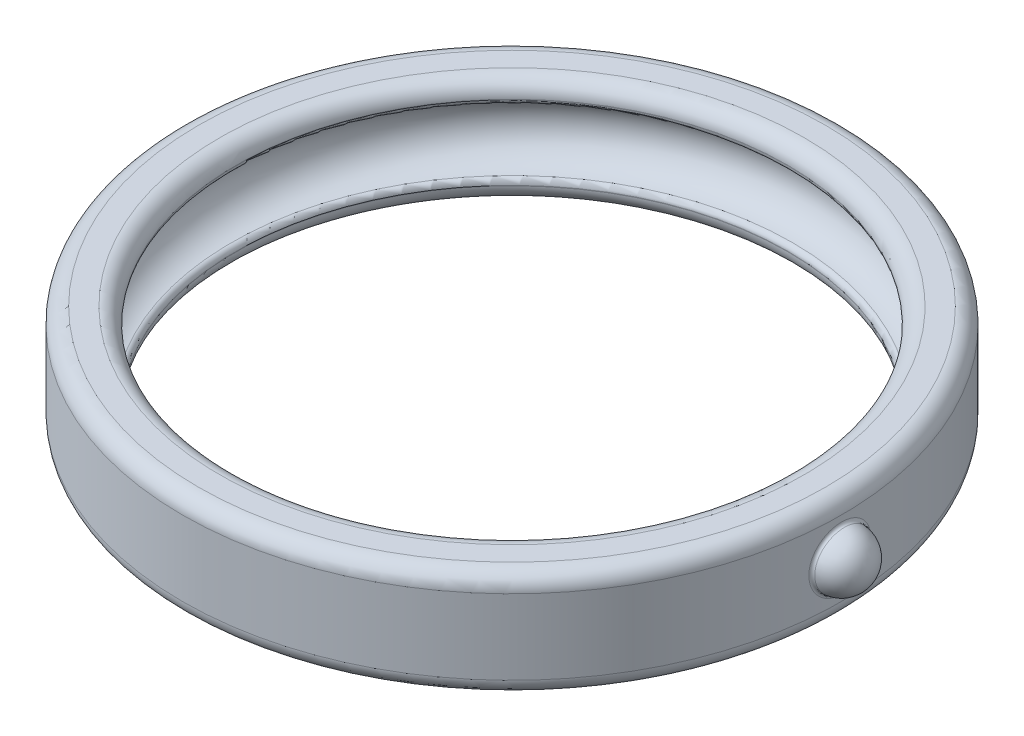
ISO-10303-21;
HEADER;
FILE_DESCRIPTION(('STEP AP214'),'2;1');
FILE_NAME('part.step','',(''),(''),'','','');
FILE_SCHEMA(('AUTOMOTIVE_DESIGN { 1 0 10303 214 1 1 1 1 }'));
ENDSEC;
DATA;
#1=APPLICATION_CONTEXT('core data for automotive mechanical design processes');
#2=APPLICATION_PROTOCOL_DEFINITION('international standard','automotive_design',2000,#1);
#3=PRODUCT_CONTEXT('',#1,'mechanical');
#4=PRODUCT('Part','Part','',(#3));
#5=PRODUCT_RELATED_PRODUCT_CATEGORY('part','',(#4));
#6=PRODUCT_DEFINITION_FORMATION('','',#4);
#7=PRODUCT_DEFINITION_CONTEXT('part definition',#1,'design');
#8=PRODUCT_DEFINITION('design','',#6,#7);
#9=PRODUCT_DEFINITION_SHAPE('','',#8);
#10=(LENGTH_UNIT() NAMED_UNIT(*) SI_UNIT(.MILLI.,.METRE.));
#11=(NAMED_UNIT(*) PLANE_ANGLE_UNIT() SI_UNIT($,.RADIAN.));
#12=(NAMED_UNIT(*) SI_UNIT($,.STERADIAN.) SOLID_ANGLE_UNIT());
#13=UNCERTAINTY_MEASURE_WITH_UNIT(LENGTH_MEASURE(1.E-05),#10,'distance_accuracy_value','');
#14=(GEOMETRIC_REPRESENTATION_CONTEXT(3) GLOBAL_UNCERTAINTY_ASSIGNED_CONTEXT((#13)) GLOBAL_UNIT_ASSIGNED_CONTEXT((#10,
#11,#12)) REPRESENTATION_CONTEXT('',''));
#15=CARTESIAN_POINT('',(0.,0.,0.));
#16=DIRECTION('',(0.,0.,1.));
#17=DIRECTION('',(1.,0.,0.));
#18=AXIS2_PLACEMENT_3D('',#15,#16,#17);
#19=CARTESIAN_POINT('',(0.,8.5,0.));
#20=DIRECTION('',(0.,-1.,0.));
#21=DIRECTION('',(0.,0.,-1.));
#22=AXIS2_PLACEMENT_3D('',#19,#20,#21);
#23=TOROIDAL_SURFACE('',#22,27.3,1.5);
#24=CARTESIAN_POINT('',(0.,8.5,0.));
#25=DIRECTION('',(0.,-1.,0.));
#26=DIRECTION('',(0.,0.,-1.));
#27=AXIS2_PLACEMENT_3D('',#24,#25,#26);
#28=CIRCLE('',#27,25.8);
#29=CARTESIAN_POINT('',(0.,8.5,-25.8));
#30=VERTEX_POINT('',#29);
#31=EDGE_CURVE('E150',#30,#30,#28,.T.);
#32=ORIENTED_EDGE('',*,*,#31,.T.);
#33=EDGE_LOOP('',(#32));
#34=FACE_BOUND('',#33,.T.);
#35=CARTESIAN_POINT('',(0.,10.,0.));
#36=DIRECTION('',(0.,-1.,0.));
#37=DIRECTION('',(0.,0.,-1.));
#38=AXIS2_PLACEMENT_3D('',#35,#36,#37);
#39=CIRCLE('',#38,27.3);
#40=CARTESIAN_POINT('',(0.,10.,-27.3));
#41=VERTEX_POINT('',#40);
#42=EDGE_CURVE('E117',#41,#41,#39,.T.);
#43=ORIENTED_EDGE('',*,*,#42,.F.);
#44=EDGE_LOOP('',(#43));
#45=FACE_BOUND('',#44,.T.);
#46=ADVANCED_FACE('F34',(#34,#45),#23,.T.);
#47=CARTESIAN_POINT('',(27.3,10.,0.));
#48=DIRECTION('',(0.,1.,0.));
#49=DIRECTION('',(0.,0.,1.));
#50=AXIS2_PLACEMENT_3D('',#47,#48,#49);
#51=PLANE('',#50);
#52=ORIENTED_EDGE('',*,*,#42,.T.);
#53=EDGE_LOOP('',(#52));
#54=FACE_BOUND('',#53,.T.);
#55=CARTESIAN_POINT('',(0.,10.,0.));
#56=DIRECTION('',(0.,-1.,0.));
#57=DIRECTION('',(0.,0.,-1.));
#58=AXIS2_PLACEMENT_3D('',#55,#56,#57);
#59=CIRCLE('',#58,29.3);
#60=CARTESIAN_POINT('',(0.,10.,-29.3));
#61=VERTEX_POINT('',#60);
#62=EDGE_CURVE('E120',#61,#61,#59,.T.);
#63=ORIENTED_EDGE('',*,*,#62,.F.);
#64=EDGE_LOOP('',(#63));
#65=FACE_BOUND('',#64,.T.);
#66=ADVANCED_FACE('F169',(#54,#65),#51,.T.);
#67=CARTESIAN_POINT('',(0.,8.5,0.));
#68=DIRECTION('',(0.,-1.,0.));
#69=DIRECTION('',(0.,0.,-1.));
#70=AXIS2_PLACEMENT_3D('',#67,#68,#69);
#71=TOROIDAL_SURFACE('',#70,29.3,1.5);
#72=ORIENTED_EDGE('',*,*,#62,.T.);
#73=EDGE_LOOP('',(#72));
#74=FACE_BOUND('',#73,.T.);
#75=CARTESIAN_POINT('',(0.,8.5,0.));
#76=DIRECTION('',(0.,-1.,0.));
#77=DIRECTION('',(0.,0.,-1.));
#78=AXIS2_PLACEMENT_3D('',#75,#76,#77);
#79=CIRCLE('',#78,30.8);
#80=CARTESIAN_POINT('',(0.,8.5,-30.8));
#81=VERTEX_POINT('',#80);
#82=EDGE_CURVE('E123',#81,#81,#79,.T.);
#83=ORIENTED_EDGE('',*,*,#82,.F.);
#84=EDGE_LOOP('',(#83));
#85=FACE_BOUND('',#84,.T.);
#86=ADVANCED_FACE('F91',(#74,#85),#71,.T.);
#87=CARTESIAN_POINT('',(0.,0.,0.));
#88=DIRECTION('',(0.,-1.,0.));
#89=DIRECTION('',(0.,0.,-1.));
#90=AXIS2_PLACEMENT_3D('',#87,#88,#89);
#91=CYLINDRICAL_SURFACE('',#90,30.8);
#92=CARTESIAN_POINT('',(30.6615353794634,4.99922371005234,-2.91723296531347));
#93=CARTESIAN_POINT('',(30.685998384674,4.9992924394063,-2.66011489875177));
#94=CARTESIAN_POINT('',(30.943896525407,4.99930265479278,-2.64609019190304));
#95=CARTESIAN_POINT('',(30.6615394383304,4.83506199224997,-2.91719007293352));
#96=CARTESIAN_POINT('',(30.6860017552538,4.84966579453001,-2.66007546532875));
#97=CARTESIAN_POINT('',(30.9439002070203,4.85183534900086,-2.64605128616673));
#98=CARTESIAN_POINT('',(30.6628557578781,4.67090535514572,-2.90345237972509));
#99=CARTESIAN_POINT('',(30.6870966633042,4.69998600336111,-2.64742643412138));
#100=CARTESIAN_POINT('',(30.9450941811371,4.70437260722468,-2.63359044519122));
#101=CARTESIAN_POINT('',(30.6679640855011,4.3472654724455,-2.84898513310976));
#102=CARTESIAN_POINT('',(30.6913391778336,4.40509997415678,-2.59734129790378));
#103=CARTESIAN_POINT('',(30.9497277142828,4.41364525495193,-2.58418566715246));
#104=CARTESIAN_POINT('',(30.6717560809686,4.18778220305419,-2.80825571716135));
#105=CARTESIAN_POINT('',(30.6944898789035,4.25978904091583,-2.55986824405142));
#106=CARTESIAN_POINT('',(30.9531672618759,4.27038062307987,-2.54724185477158));
#107=CARTESIAN_POINT('',(30.6813878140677,3.87802532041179,-2.70098508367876));
#108=CARTESIAN_POINT('',(30.7024777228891,3.97782555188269,-2.46132711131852));
#109=CARTESIAN_POINT('',(30.9619037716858,3.99212444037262,-2.44994151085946));
#110=CARTESIAN_POINT('',(30.6872272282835,3.72775025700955,-2.63444794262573));
#111=CARTESIAN_POINT('',(30.7073194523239,3.8410977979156,-2.40019890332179));
#112=CARTESIAN_POINT('',(30.9672004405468,3.85713158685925,-2.38958867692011));
#113=CARTESIAN_POINT('',(30.7002990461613,3.44059500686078,-2.4774614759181));
#114=CARTESIAN_POINT('',(30.7181361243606,3.5801031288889,-2.25621415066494));
#115=CARTESIAN_POINT('',(30.9790572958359,3.59917856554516,-2.24719334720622));
#116=CARTESIAN_POINT('',(30.7075314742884,3.30371505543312,-2.3870117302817));
#117=CARTESIAN_POINT('',(30.7241155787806,3.45580572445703,-2.17328446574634));
#118=CARTESIAN_POINT('',(30.9856175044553,3.47621860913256,-2.16515047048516));
#119=CARTESIAN_POINT('',(30.7226100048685,3.0466821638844,-2.18439043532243));
#120=CARTESIAN_POINT('',(30.7365577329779,3.22263499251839,-1.98781268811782));
#121=CARTESIAN_POINT('',(30.9992945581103,3.24532465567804,-1.98136185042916));
#122=CARTESIAN_POINT('',(30.7304582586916,2.92659234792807,-2.07214051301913));
#123=CARTESIAN_POINT('',(30.7430242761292,3.11383537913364,-1.8851394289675));
#124=CARTESIAN_POINT('',(31.0064133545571,3.1374473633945,-1.87954501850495));
#125=CARTESIAN_POINT('',(30.7458678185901,2.70706318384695,-1.82931204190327));
#126=CARTESIAN_POINT('',(30.7556998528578,2.91511067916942,-1.66335484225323));
#127=CARTESIAN_POINT('',(31.0203906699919,2.94024319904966,-1.6592862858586));
#128=CARTESIAN_POINT('',(30.7534291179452,2.6076243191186,-1.69873306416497));
#129=CARTESIAN_POINT('',(30.7619077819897,2.82523785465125,-1.54421350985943));
#130=CARTESIAN_POINT('',(31.0272491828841,2.85091676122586,-1.54084399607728));
#131=CARTESIAN_POINT('',(30.7674527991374,2.43175970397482,-1.42233858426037));
#132=CARTESIAN_POINT('',(30.7734078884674,2.66637328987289,-1.29232091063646));
#133=CARTESIAN_POINT('',(31.0399694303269,2.69293668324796,-1.29013905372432));
#134=CARTESIAN_POINT('',(30.7739103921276,2.35543318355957,-1.27646090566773));
#135=CARTESIAN_POINT('',(30.7786920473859,2.5975449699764,-1.15952989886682));
#136=CARTESIAN_POINT('',(31.0458268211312,2.62437218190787,-1.15782000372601));
#137=CARTESIAN_POINT('',(30.7849651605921,2.22846870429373,-0.97405918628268));
#138=CARTESIAN_POINT('',(30.7877330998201,2.48306449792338,-0.884461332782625));
#139=CARTESIAN_POINT('',(31.0558541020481,2.51031934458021,-0.883525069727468));
#140=CARTESIAN_POINT('',(30.7895623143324,2.17783104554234,-0.817535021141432));
#141=CARTESIAN_POINT('',(30.7914848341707,2.43748421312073,-0.74224537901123));
#142=CARTESIAN_POINT('',(31.0600239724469,2.46483127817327,-0.741549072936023));
#143=CARTESIAN_POINT('',(30.7963904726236,2.10355664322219,-0.497919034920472));
#144=CARTESIAN_POINT('',(30.797058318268,2.37060199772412,-0.45191946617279));
#145=CARTESIAN_POINT('',(31.0662174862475,2.39811020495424,-0.451639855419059));
#146=CARTESIAN_POINT('',(30.7986163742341,2.07997812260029,-0.334813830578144));
#147=CARTESIAN_POINT('',(30.7988718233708,2.34940258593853,-0.303898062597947));
#148=CARTESIAN_POINT('',(31.0682365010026,2.37692950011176,-0.303694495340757));
#149=CARTESIAN_POINT('',(30.8004353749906,2.06066716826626,-0.0069808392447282));
#150=CARTESIAN_POINT('',(30.8003551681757,2.3320248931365,-0.00630978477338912));
#151=CARTESIAN_POINT('',(31.0698864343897,2.35958237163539,-0.00633200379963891));
#152=CARTESIAN_POINT('',(30.8000284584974,2.06493489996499,0.157746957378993));
#153=CARTESIAN_POINT('',(30.8000237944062,2.33586080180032,0.143136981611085));
#154=CARTESIAN_POINT('',(31.0695173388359,2.36341609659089,0.143085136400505));
#155=CARTESIAN_POINT('',(30.7966262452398,2.10121173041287,0.484226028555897));
#156=CARTESIAN_POINT('',(30.7972488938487,2.36850982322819,0.439533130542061));
#157=CARTESIAN_POINT('',(31.0664313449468,2.39600375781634,0.439219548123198));
#158=CARTESIAN_POINT('',(30.7936298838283,2.13323223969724,0.645976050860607));
#159=CARTESIAN_POINT('',(30.7948067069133,2.3973071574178,0.586364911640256));
#160=CARTESIAN_POINT('',(31.0637134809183,2.42476794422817,0.585935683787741));
#161=CARTESIAN_POINT('',(30.7853844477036,2.22412805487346,0.961815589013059));
#162=CARTESIAN_POINT('',(30.7880730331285,2.47918420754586,0.873361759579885));
#163=CARTESIAN_POINT('',(31.0562344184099,2.50642011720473,0.872419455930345));
#164=CARTESIAN_POINT('',(30.7801353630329,2.28300347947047,1.11590507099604));
#165=CARTESIAN_POINT('',(30.7837861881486,2.5322052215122,1.01343654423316));
#166=CARTESIAN_POINT('',(31.051473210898,2.55930821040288,1.01218706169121));
#167=CARTESIAN_POINT('',(30.7679687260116,2.426046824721,1.412114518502));
#168=CARTESIAN_POINT('',(30.7738280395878,2.66125216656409,1.28302047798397));
#169=CARTESIAN_POINT('',(31.0404374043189,2.68780477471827,1.28086526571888));
#170=CARTESIAN_POINT('',(30.7610513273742,2.51021241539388,1.55423558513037));
#171=CARTESIAN_POINT('',(30.7681619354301,2.73720086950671,1.41248231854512));
#172=CARTESIAN_POINT('',(31.0341629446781,2.76341115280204,1.40977686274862));
#173=CARTESIAN_POINT('',(30.7500208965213,2.65349865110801,1.75520803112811));
#174=CARTESIAN_POINT('',(30.7591032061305,2.86678886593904,1.59585917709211));
#175=CARTESIAN_POINT('',(31.0241577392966,2.89212590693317,1.59206988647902));
#176=CARTESIAN_POINT('',(30.7462342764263,2.70411121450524,1.82017477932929));
#177=CARTESIAN_POINT('',(30.7559928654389,2.91255668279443,1.65514103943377));
#178=CARTESIAN_POINT('',(31.0207230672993,2.93759142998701,1.65099828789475));
#179=CARTESIAN_POINT('',(30.7385453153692,2.81073759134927,1.94570872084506));
#180=CARTESIAN_POINT('',(30.7496718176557,3.00903893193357,1.76974938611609));
#181=CARTESIAN_POINT('',(31.0137487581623,3.03337444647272,1.76486445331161));
#182=CARTESIAN_POINT('',(30.7346428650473,2.86675662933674,2.0062715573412));
#183=CARTESIAN_POINT('',(30.7464612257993,3.05975096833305,1.82507485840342));
#184=CARTESIAN_POINT('',(31.0102090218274,3.08369663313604,1.8197982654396));
#185=CARTESIAN_POINT('',(30.7229484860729,3.04206668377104,2.18035203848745));
#186=CARTESIAN_POINT('',(30.7368373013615,3.21846540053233,1.98409273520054));
#187=CARTESIAN_POINT('',(30.9996015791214,3.24117854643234,1.97769880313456));
#188=CARTESIAN_POINT('',(30.7151493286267,3.16886203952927,2.28661356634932));
#189=CARTESIAN_POINT('',(30.7304040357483,3.33342673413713,2.08136467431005));
#190=CARTESIAN_POINT('',(30.9925273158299,3.35507945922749,2.07408383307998));
#191=CARTESIAN_POINT('',(30.7004303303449,3.43877748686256,2.47642906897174));
#192=CARTESIAN_POINT('',(30.7182469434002,3.57844456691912,2.25523121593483));
#193=CARTESIAN_POINT('',(30.9791763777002,3.59754587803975,2.24625689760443));
#194=CARTESIAN_POINT('',(30.6935104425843,3.58189670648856,2.55998425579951));
#195=CARTESIAN_POINT('',(30.7125198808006,3.70850013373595,2.3318957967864));
#196=CARTESIAN_POINT('',(30.9728996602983,3.72611060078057,2.32204603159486));
#197=CARTESIAN_POINT('',(30.6843881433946,3.80542330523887,2.66637842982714));
#198=CARTESIAN_POINT('',(30.7049616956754,3.91186649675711,2.4295802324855));
#199=CARTESIAN_POINT('',(30.9646252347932,3.92690568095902,2.41855137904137));
#200=CARTESIAN_POINT('',(30.6815587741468,3.88134085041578,2.69866795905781));
#201=CARTESIAN_POINT('',(30.702616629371,3.98093848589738,2.4592311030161));
#202=CARTESIAN_POINT('',(30.9620588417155,3.99510279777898,2.44783975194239));
#203=CARTESIAN_POINT('',(30.6763926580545,4.03559454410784,2.75676933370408));
#204=CARTESIAN_POINT('',(30.6983334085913,4.12132279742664,2.51259377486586));
#205=CARTESIAN_POINT('',(30.9573728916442,4.13366967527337,2.50054088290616));
#206=CARTESIAN_POINT('',(30.6740554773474,4.11392849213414,2.78258688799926));
#207=CARTESIAN_POINT('',(30.6963942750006,4.19264152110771,2.53631920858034));
#208=CARTESIAN_POINT('',(30.955252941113,4.20403745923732,2.5239588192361));
#209=CARTESIAN_POINT('',(30.6678904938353,4.35173579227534,2.8500194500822));
#210=CARTESIAN_POINT('',(30.6912800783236,4.40913429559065,2.59827002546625));
#211=CARTESIAN_POINT('',(30.9496609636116,4.417660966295,2.58512384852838));
#212=CARTESIAN_POINT('',(30.6648990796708,4.51425563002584,2.88172884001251));
#213=CARTESIAN_POINT('',(30.6887934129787,4.55726097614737,2.62745389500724));
#214=CARTESIAN_POINT('',(30.9469475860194,4.56365336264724,2.61388600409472));
#215=CARTESIAN_POINT('',(30.6620977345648,4.78459659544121,2.9113318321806));
#216=CARTESIAN_POINT('',(30.6864658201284,4.80365070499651,2.65468507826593));
#217=CARTESIAN_POINT('',(30.9444066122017,4.80650202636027,2.64073754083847));
#218=CARTESIAN_POINT('',(30.6615400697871,4.89161746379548,2.91718364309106));
#219=CARTESIAN_POINT('',(30.6860022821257,4.90121269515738,2.66006953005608));
#220=CARTESIAN_POINT('',(30.9439007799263,4.90263941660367,2.64604545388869));
#221=CARTESIAN_POINT('',(30.6615307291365,5.10566456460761,2.91728186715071));
#222=CARTESIAN_POINT('',(30.6859945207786,5.09630983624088,2.66015988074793));
#223=CARTESIAN_POINT('',(30.9438923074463,5.09491901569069,2.64613454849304));
#224=CARTESIAN_POINT('',(30.6620790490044,5.21269079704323,2.91152832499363));
#225=CARTESIAN_POINT('',(30.6864502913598,5.19387682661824,2.65486585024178));
#226=CARTESIAN_POINT('',(30.9443896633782,5.19106122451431,2.64091577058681));
#227=CARTESIAN_POINT('',(30.6648516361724,5.48252390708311,2.88223215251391));
#228=CARTESIAN_POINT('',(30.6887539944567,5.43980393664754,2.62791688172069));
#229=CARTESIAN_POINT('',(30.9469045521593,5.43345367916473,2.61434253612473));
#230=CARTESIAN_POINT('',(30.6678154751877,5.64454617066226,2.85082042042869));
#231=CARTESIAN_POINT('',(30.6912177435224,5.5874776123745,2.59900695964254));
#232=CARTESIAN_POINT('',(30.9495929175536,5.57899910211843,2.58585037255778));
#233=CARTESIAN_POINT('',(30.6739311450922,5.88167581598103,2.7839556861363));
#234=CARTESIAN_POINT('',(30.6962911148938,5.80335599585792,2.53757705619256));
#235=CARTESIAN_POINT('',(30.9551401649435,5.7920138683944,2.52520039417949));
#236=CARTESIAN_POINT('',(30.6762505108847,5.95979436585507,2.75834823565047));
#237=CARTESIAN_POINT('',(30.6982154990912,5.87447943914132,2.51404444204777));
#238=CARTESIAN_POINT('',(30.957243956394,5.86218815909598,2.50197303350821));
#239=CARTESIAN_POINT('',(30.6813792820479,6.1136438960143,2.700705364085));
#240=CARTESIAN_POINT('',(30.7024678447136,6.01449789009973,2.4611021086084));
#241=CARTESIAN_POINT('',(30.961896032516,6.00039197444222,2.44968778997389));
#242=CARTESIAN_POINT('',(30.6841891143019,6.18937272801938,2.66866433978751));
#243=CARTESIAN_POINT('',(30.7047967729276,6.08339931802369,2.4316789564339));
#244=CARTESIAN_POINT('',(30.9644447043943,6.06841956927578,2.42062482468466));
#245=CARTESIAN_POINT('',(30.6932292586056,6.41182938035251,2.56333121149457));
#246=CARTESIAN_POINT('',(30.7122870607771,6.28579494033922,2.33496735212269));
#247=CARTESIAN_POINT('',(30.9726446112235,6.26825351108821,2.32508190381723));
#248=CARTESIAN_POINT('',(30.700079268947,6.55415894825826,2.48073514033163));
#249=CARTESIAN_POINT('',(30.7179565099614,6.41513683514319,2.25918104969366));
#250=CARTESIAN_POINT('',(30.978857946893,6.39610888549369,2.25016274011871));
#251=CARTESIAN_POINT('',(30.7146620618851,6.82279553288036,2.29310474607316));
#252=CARTESIAN_POINT('',(30.7300017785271,6.65900295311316,2.08730919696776));
#253=CARTESIAN_POINT('',(30.9920853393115,6.63742649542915,2.07997168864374));
#254=CARTESIAN_POINT('',(30.722394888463,6.94910175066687,2.18806930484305));
#255=CARTESIAN_POINT('',(30.7363808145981,6.77352718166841,1.99115489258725));
#256=CARTESIAN_POINT('',(30.9990994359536,6.7508880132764,1.98469878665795));
#257=CARTESIAN_POINT('',(30.7340141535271,7.12405642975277,2.01586371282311));
#258=CARTESIAN_POINT('',(30.7459437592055,6.93192958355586,1.83383970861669));
#259=CARTESIAN_POINT('',(31.0096387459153,6.90805069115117,1.82849887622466));
#260=CARTESIAN_POINT('',(30.7378990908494,7.18006361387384,1.95587253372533));
#261=CARTESIAN_POINT('',(30.7491402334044,6.98263404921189,1.77903299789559));
#262=CARTESIAN_POINT('',(31.0131625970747,6.95836222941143,1.77408358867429));
#263=CARTESIAN_POINT('',(30.7455604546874,7.28674368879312,1.83150153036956));
#264=CARTESIAN_POINT('',(30.7554391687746,7.07917088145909,1.66547907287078));
#265=CARTESIAN_POINT('',(31.0201118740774,7.05419348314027,1.66127227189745));
#266=CARTESIAN_POINT('',(30.7493369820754,7.33742166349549,1.76712598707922));
#267=CARTESIAN_POINT('',(30.758541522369,7.12500093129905,1.60673270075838));
#268=CARTESIAN_POINT('',(31.0235373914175,7.0997177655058,1.60288012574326));
#269=CARTESIAN_POINT('',(30.7603504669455,7.48102551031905,1.5679447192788));
#270=CARTESIAN_POINT('',(30.7675871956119,7.25488452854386,1.4249779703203));
#271=CARTESIAN_POINT('',(31.033527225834,7.2287178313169,1.42221179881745));
#272=CARTESIAN_POINT('',(30.7672741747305,7.565562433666,1.42704378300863));
#273=CARTESIAN_POINT('',(30.7732591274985,7.33117455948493,1.29661755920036));
#274=CARTESIAN_POINT('',(31.039807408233,7.304657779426,1.29440692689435));
#275=CARTESIAN_POINT('',(30.7795180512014,7.70994258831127,1.13271538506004));
#276=CARTESIAN_POINT('',(30.7832814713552,7.46143633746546,1.02872680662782));
#277=CARTESIAN_POINT('',(31.050913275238,7.43435520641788,1.02743493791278));
#278=CARTESIAN_POINT('',(30.7848322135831,7.76969362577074,0.979243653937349));
#279=CARTESIAN_POINT('',(30.7876218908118,7.51524952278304,0.889204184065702));
#280=CARTESIAN_POINT('',(31.055733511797,7.48802986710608,0.888227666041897));
#281=CARTESIAN_POINT('',(30.7932331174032,7.86247533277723,0.664492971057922));
#282=CARTESIAN_POINT('',(30.794482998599,7.59882925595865,0.603182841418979));
#283=CARTESIAN_POINT('',(31.0633535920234,7.5713761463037,0.602731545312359));
#284=CARTESIAN_POINT('',(30.7963198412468,7.89550579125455,0.503213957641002));
#285=CARTESIAN_POINT('',(30.7969989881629,7.62853612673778,0.456772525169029));
#286=CARTESIAN_POINT('',(31.0661534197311,7.60104757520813,0.456442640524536));
#287=CARTESIAN_POINT('',(30.799922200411,7.93394615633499,0.177202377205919));
#288=CARTESIAN_POINT('',(30.799937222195,7.66313306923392,0.160794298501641));
#289=CARTESIAN_POINT('',(31.0694209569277,7.63557875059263,0.160732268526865));
#290=CARTESIAN_POINT('',(30.8004341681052,7.93931666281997,0.0124652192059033));
#291=CARTESIAN_POINT('',(30.8003541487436,7.66796020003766,0.0113381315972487));
#292=CARTESIAN_POINT('',(31.0698853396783,7.6404031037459,0.0113066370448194));
#293=CARTESIAN_POINT('',(30.7988201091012,7.92218758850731,-0.315569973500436));
#294=CARTESIAN_POINT('',(30.7990379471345,7.65254610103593,-0.286430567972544));
#295=CARTESIAN_POINT('',(31.0684212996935,7.625015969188,-0.286239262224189));
#296=CARTESIAN_POINT('',(30.7966940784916,7.89968796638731,-0.478868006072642));
#297=CARTESIAN_POINT('',(30.797305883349,7.63231730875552,-0.434622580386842));
#298=CARTESIAN_POINT('',(31.0664928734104,7.60480444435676,-0.434359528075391));
#299=CARTESIAN_POINT('',(30.7900414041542,7.82743120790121,-0.799417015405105));
#300=CARTESIAN_POINT('',(30.791875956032,7.56725456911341,-0.725783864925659));
#301=CARTESIAN_POINT('',(31.060458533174,7.53989583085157,-0.725115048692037));
#302=CARTESIAN_POINT('',(30.7855143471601,7.77766937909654,-0.956666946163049));
#303=CARTESIAN_POINT('',(30.7881817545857,7.52246539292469,-0.868650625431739));
#304=CARTESIAN_POINT('',(31.0563522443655,7.49519452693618,-0.867749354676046));
#305=CARTESIAN_POINT('',(30.7745670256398,7.65225905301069,-1.26062450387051));
#306=CARTESIAN_POINT('',(30.7792293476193,7.40939290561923,-1.14511749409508));
#307=CARTESIAN_POINT('',(31.0464224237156,7.3825377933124,-1.14345551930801));
#308=CARTESIAN_POINT('',(30.76814675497,7.57661047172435,-1.40733209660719));
#309=CARTESIAN_POINT('',(30.7739763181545,7.34118120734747,-1.27865375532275));
#310=CARTESIAN_POINT('',(31.0405988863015,7.31458228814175,-1.27652734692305));
#311=CARTESIAN_POINT('',(30.7541368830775,7.40155029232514,-1.68598585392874));
#312=CARTESIAN_POINT('',(30.762488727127,7.18305472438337,-1.5325863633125));
#313=CARTESIAN_POINT('',(31.0278911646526,7.15732483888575,-1.52928157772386));
#314=CARTESIAN_POINT('',(30.7465476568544,7.3021463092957,-1.81793672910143));
#315=CARTESIAN_POINT('',(30.7562585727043,7.09322062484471,-1.65297042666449));
#316=CARTESIAN_POINT('',(31.0210073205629,7.06802973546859,-1.64896825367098));
#317=CARTESIAN_POINT('',(30.7310538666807,7.08232966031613,-2.06336600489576));
#318=CARTESIAN_POINT('',(30.743514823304,6.89424749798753,-1.87711653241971));
#319=CARTESIAN_POINT('',(31.0069536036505,6.87056732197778,-1.87158605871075));
#320=CARTESIAN_POINT('',(30.7231493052,6.96191715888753,-2.17684455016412));
#321=CARTESIAN_POINT('',(30.7370024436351,6.78516229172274,-1.98090780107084));
#322=CARTESIAN_POINT('',(30.9997837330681,6.76240015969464,-1.97451731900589));
#323=CARTESIAN_POINT('',(30.7079348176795,6.70371581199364,-2.38187274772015));
#324=CARTESIAN_POINT('',(30.7244489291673,6.55094215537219,-2.16857392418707));
#325=CARTESIAN_POINT('',(30.9859833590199,6.53045657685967,-2.16048913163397));
#326=CARTESIAN_POINT('',(30.7006237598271,6.56596138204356,-2.47346481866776));
#327=CARTESIAN_POINT('',(30.7184047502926,6.42585525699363,-2.25254860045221));
#328=CARTESIAN_POINT('',(30.9793518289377,6.40671107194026,-2.24356816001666));
#329=CARTESIAN_POINT('',(30.6874083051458,6.27678181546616,-2.63236706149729));
#330=CARTESIAN_POINT('',(30.7074695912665,6.16302659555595,-2.3982869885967));
#331=CARTESIAN_POINT('',(30.9673646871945,6.14693959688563,-2.38770120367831));
#332=CARTESIAN_POINT('',(30.6815038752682,6.1253570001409,-2.69967780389));
#333=CARTESIAN_POINT('',(30.7025739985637,6.02525425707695,-2.46012578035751));
#334=CARTESIAN_POINT('',(30.9620090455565,6.01091391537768,-2.44875573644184));
#335=CARTESIAN_POINT('',(30.6717946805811,5.81380285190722,-2.80784034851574));
#336=CARTESIAN_POINT('',(30.694521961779,5.74165562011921,-2.55948594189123));
#337=CARTESIAN_POINT('',(30.9532022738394,5.73104323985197,-2.54686509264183));
#338=CARTESIAN_POINT('',(30.667981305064,5.65371224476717,-2.8488007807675));
#339=CARTESIAN_POINT('',(30.6913534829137,5.59579127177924,-2.59717172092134));
#340=CARTESIAN_POINT('',(30.9497433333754,5.58723303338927,-2.5840184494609));
#341=CARTESIAN_POINT('',(30.6628496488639,5.32882054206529,-2.90351827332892));
#342=CARTESIAN_POINT('',(30.6870916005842,5.29976479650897,-2.64748690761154));
#343=CARTESIAN_POINT('',(30.9450886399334,5.29538116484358,-2.63365021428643));
#344=CARTESIAN_POINT('',(30.6615313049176,5.16401956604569,-2.91727602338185));
#345=CARTESIAN_POINT('',(30.6859950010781,5.14949689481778,-2.66015448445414));
#346=CARTESIAN_POINT('',(30.9438928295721,5.14733961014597,-2.64612924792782));
#347=CARTESIAN_POINT('',(30.6615353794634,4.99922371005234,-2.91723296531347));
#348=CARTESIAN_POINT('',(30.685998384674,4.9992924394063,-2.66011489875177));
#349=CARTESIAN_POINT('',(30.943896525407,4.99930265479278,-2.64609019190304));
#350=(BOUNDED_SURFACE() B_SPLINE_SURFACE(3,2,((#92,#93,#94),(#95,#96,#97),(#98,#99,#100),(#101,
#102,#103),(#104,#105,#106),(#107,#108,#109),(#110,#111,#112),(#113,#114,#115),(#116,#117,#118),
(#119,#120,#121),(#122,#123,#124),(#125,#126,#127),(#128,#129,#130),(#131,#132,#133),(#134,#135,
#136),(#137,#138,#139),(#140,#141,#142),(#143,#144,#145),(#146,#147,#148),(#149,#150,#151),
(#152,#153,#154),(#155,#156,#157),(#158,#159,#160),(#161,#162,#163),(#164,#165,#166),(#167,#168,
#169),(#170,#171,#172),(#173,#174,#175),(#176,#177,#178),(#179,#180,#181),(#182,#183,#184),
(#185,#186,#187),(#188,#189,#190),(#191,#192,#193),(#194,#195,#196),(#197,#198,#199),(#200,#201,
#202),(#203,#204,#205),(#206,#207,#208),(#209,#210,#211),(#212,#213,#214),(#215,#216,#217),
(#218,#219,#220),(#221,#222,#223),(#224,#225,#226),(#227,#228,#229),(#230,#231,#232),(#233,#234,
#235),(#236,#237,#238),(#239,#240,#241),(#242,#243,#244),(#245,#246,#247),(#248,#249,#250),
(#251,#252,#253),(#254,#255,#256),(#257,#258,#259),(#260,#261,#262),(#263,#264,#265),(#266,#267,
#268),(#269,#270,#271),(#272,#273,#274),(#275,#276,#277),(#278,#279,#280),(#281,#282,#283),
(#284,#285,#286),(#287,#288,#289),(#290,#291,#292),(#293,#294,#295),(#296,#297,#298),(#299,#300,
#301),(#302,#303,#304),(#305,#306,#307),(#308,#309,#310),(#311,#312,#313),(#314,#315,#316),
(#317,#318,#319),(#320,#321,#322),(#323,#324,#325),(#326,#327,#328),(#329,#330,#331),(#332,#333,
#334),(#335,#336,#337),(#338,#339,#340),(#341,#342,#343),(#344,#345,#346),(#347,#348,#349)),
.UNSPECIFIED.,.T.,.F.,.F.) B_SPLINE_SURFACE_WITH_KNOTS((4,2,2,2,2,2,2,2,2,2,2,2,2,2,2,2,2,2,2,2,
2,2,2,2,2,2,2,2,2,2,2,2,2,2,2,2,2,2,2,2,2,2,4),(3,3),(0.,0.491900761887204,0.983799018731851,
1.47561960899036,1.96744883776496,2.46108009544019,2.9547229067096,3.45045600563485,
3.94619489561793,4.44299847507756,4.93980500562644,5.43681589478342,5.93382898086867,
6.43079629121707,6.67937111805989,6.92818860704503,7.42453319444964,7.9208512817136,
8.16860384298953,8.41613708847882,8.91041100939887,9.2313872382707,9.55236223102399,
10.0450242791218,10.2917448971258,10.5386813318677,11.0315325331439,11.5244082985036,
11.7719303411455,12.0192140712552,12.5136093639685,13.0098274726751,13.5060495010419,
14.0029781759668,14.4999075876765,14.9969225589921,15.4939391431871,15.9907966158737,
16.4876501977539,16.9835328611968,17.4794038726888,17.9732173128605,18.4670182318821),(0.,1.),
.UNSPECIFIED.) GEOMETRIC_REPRESENTATION_ITEM() RATIONAL_B_SPLINE_SURFACE(((1.,0.757836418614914,
1.),(1.,0.75783596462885,1.),(1.,0.757688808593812,1.),(1.,0.757117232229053,1.),(1.,
0.756692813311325,1.),(1.,0.755613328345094,1.),(1.,0.754958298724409,1.),(1.,0.75348952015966,
1.),(1.,0.752675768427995,1.),(1.,0.750976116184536,1.),(1.,0.750089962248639,1.),(1.,
0.74834695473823,1.),(1.,0.747490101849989,1.),(1.,0.745898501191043,1.),(1.,0.745164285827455,
1.),(1.,0.743906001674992,1.),(1.,0.743381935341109,1.),(1.,0.742603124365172,1.),(1.,
0.742348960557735,1.),(1.,0.742141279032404,1.),(1.,0.742187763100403,1.),(1.,0.742576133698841,
1.),(1.,0.74291814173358,1.),(1.,0.74385810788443,1.),(1.,0.744456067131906,1.),(1.,
0.745839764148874,1.),(1.,0.746625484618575,1.),(1.,0.747876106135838,1.),(1.,0.748305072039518,
1.),(1.,0.749175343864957,1.),(1.,0.749616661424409,1.),(1.,0.750937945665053,1.),(1.,
0.751817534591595,1.),(1.,0.753474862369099,1.),(1.,0.754252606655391,1.),(1.,0.755276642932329,
1.),(1.,0.75559402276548,1.),(1.,0.75617321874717,1.),(1.,0.75643508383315,1.),(1.,
0.7571255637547,1.),(1.,0.757460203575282,1.),(1.,0.757773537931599,1.),(1.,0.757835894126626,
1.),(1.,0.757836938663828,1.),(1.,0.757775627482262,1.),(1.,0.757465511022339,1.),(1.,
0.757133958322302,1.),(1.,0.756449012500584,1.),(1.,0.756189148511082,1.),(1.,0.755614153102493,
1.),(1.,0.755298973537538,1.),(1.,0.754284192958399,1.),(1.,0.753514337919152,1.),(1.,
0.751872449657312,1.),(1.,0.751000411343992,1.),(1.,0.749687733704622,1.),(1.,0.749248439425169,
1.),(1.,0.748381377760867,1.),(1.,0.747953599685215,1.),(1.,0.746705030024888,1.),(1.,
0.74591868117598,1.),(1.,0.744526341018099,1.),(1.,0.743921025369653,1.),(1.,0.742963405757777,
1.),(1.,0.742611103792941,1.),(1.,0.742199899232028,1.),(1.,0.742141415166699,1.),(1.,
0.742325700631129,1.),(1.,0.74256847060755,1.),(1.,0.743327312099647,1.),(1.,0.74384343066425,
1.),(1.,0.745089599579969,1.),(1.,0.745819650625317,1.),(1.,0.747409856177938,1.),(1.,
0.748269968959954,1.),(1.,0.750022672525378,1.),(1.,0.750915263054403,1.),(1.,0.752630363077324,
1.),(1.,0.753453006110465,1.),(1.,0.754937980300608,1.),(1.,0.755600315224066,1.),(1.,
0.756688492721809,1.),(1.,0.757115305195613,1.),(1.,0.757689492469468,1.),(1.,0.757836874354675,
1.),(1.,0.757836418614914,1.))) REPRESENTATION_ITEM('') SURFACE());
#351=CARTESIAN_POINT('',(30.6615353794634,4.99922371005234,-2.91723296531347));
#352=CARTESIAN_POINT('',(30.6615394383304,4.83506199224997,-2.91719007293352));
#353=CARTESIAN_POINT('',(30.6628557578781,4.67090535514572,-2.90345237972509));
#354=CARTESIAN_POINT('',(30.6679640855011,4.3472654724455,-2.84898513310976));
#355=CARTESIAN_POINT('',(30.6717560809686,4.18778220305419,-2.80825571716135));
#356=CARTESIAN_POINT('',(30.6813878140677,3.87802532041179,-2.70098508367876));
#357=CARTESIAN_POINT('',(30.6872272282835,3.72775025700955,-2.63444794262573));
#358=CARTESIAN_POINT('',(30.7002990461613,3.44059500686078,-2.4774614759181));
#359=CARTESIAN_POINT('',(30.7075314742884,3.30371505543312,-2.3870117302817));
#360=CARTESIAN_POINT('',(30.7226100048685,3.0466821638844,-2.18439043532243));
#361=CARTESIAN_POINT('',(30.7304582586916,2.92659234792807,-2.07214051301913));
#362=CARTESIAN_POINT('',(30.7458678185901,2.70706318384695,-1.82931204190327));
#363=CARTESIAN_POINT('',(30.7534291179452,2.6076243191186,-1.69873306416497));
#364=CARTESIAN_POINT('',(30.7674527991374,2.43175970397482,-1.42233858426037));
#365=CARTESIAN_POINT('',(30.7739103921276,2.35543318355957,-1.27646090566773));
#366=CARTESIAN_POINT('',(30.7849651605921,2.22846870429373,-0.97405918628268));
#367=CARTESIAN_POINT('',(30.7895623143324,2.17783104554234,-0.817535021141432));
#368=CARTESIAN_POINT('',(30.7963904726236,2.10355664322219,-0.497919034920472));
#369=CARTESIAN_POINT('',(30.7986163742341,2.07997812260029,-0.334813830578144));
#370=CARTESIAN_POINT('',(30.8004353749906,2.06066716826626,-0.0069808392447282));
#371=CARTESIAN_POINT('',(30.8000284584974,2.06493489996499,0.157746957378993));
#372=CARTESIAN_POINT('',(30.7966262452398,2.10121173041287,0.484226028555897));
#373=CARTESIAN_POINT('',(30.7936298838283,2.13323223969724,0.645976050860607));
#374=CARTESIAN_POINT('',(30.7853844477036,2.22412805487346,0.961815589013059));
#375=CARTESIAN_POINT('',(30.7801353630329,2.28300347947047,1.11590507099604));
#376=CARTESIAN_POINT('',(30.7679687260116,2.426046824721,1.412114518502));
#377=CARTESIAN_POINT('',(30.7610513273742,2.51021241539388,1.55423558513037));
#378=CARTESIAN_POINT('',(30.7500208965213,2.65349865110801,1.75520803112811));
#379=CARTESIAN_POINT('',(30.7462342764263,2.70411121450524,1.82017477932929));
#380=CARTESIAN_POINT('',(30.7385453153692,2.81073759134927,1.94570872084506));
#381=CARTESIAN_POINT('',(30.7346428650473,2.86675662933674,2.0062715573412));
#382=CARTESIAN_POINT('',(30.7229484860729,3.04206668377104,2.18035203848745));
#383=CARTESIAN_POINT('',(30.7151493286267,3.16886203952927,2.28661356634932));
#384=CARTESIAN_POINT('',(30.7004303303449,3.43877748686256,2.47642906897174));
#385=CARTESIAN_POINT('',(30.6935104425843,3.58189670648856,2.55998425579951));
#386=CARTESIAN_POINT('',(30.6843881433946,3.80542330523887,2.66637842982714));
#387=CARTESIAN_POINT('',(30.6815587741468,3.88134085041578,2.69866795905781));
#388=CARTESIAN_POINT('',(30.6763926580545,4.03559454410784,2.75676933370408));
#389=CARTESIAN_POINT('',(30.6740554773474,4.11392849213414,2.78258688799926));
#390=CARTESIAN_POINT('',(30.6678904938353,4.35173579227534,2.8500194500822));
#391=CARTESIAN_POINT('',(30.6648990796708,4.51425563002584,2.88172884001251));
#392=CARTESIAN_POINT('',(30.6620977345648,4.78459659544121,2.9113318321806));
#393=CARTESIAN_POINT('',(30.6615400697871,4.89161746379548,2.91718364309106));
#394=CARTESIAN_POINT('',(30.6615307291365,5.10566456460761,2.91728186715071));
#395=CARTESIAN_POINT('',(30.6620790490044,5.21269079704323,2.91152832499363));
#396=CARTESIAN_POINT('',(30.6648516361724,5.48252390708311,2.88223215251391));
#397=CARTESIAN_POINT('',(30.6678154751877,5.64454617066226,2.8508204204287));
#398=CARTESIAN_POINT('',(30.6739311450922,5.88167581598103,2.7839556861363));
#399=CARTESIAN_POINT('',(30.6762505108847,5.95979436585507,2.75834823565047));
#400=CARTESIAN_POINT('',(30.6813792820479,6.1136438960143,2.700705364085));
#401=CARTESIAN_POINT('',(30.6841891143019,6.18937272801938,2.66866433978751));
#402=CARTESIAN_POINT('',(30.6932292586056,6.41182938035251,2.56333121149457));
#403=CARTESIAN_POINT('',(30.700079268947,6.55415894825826,2.48073514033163));
#404=CARTESIAN_POINT('',(30.7146620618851,6.82279553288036,2.29310474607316));
#405=CARTESIAN_POINT('',(30.722394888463,6.94910175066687,2.18806930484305));
#406=CARTESIAN_POINT('',(30.7340141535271,7.12405642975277,2.01586371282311));
#407=CARTESIAN_POINT('',(30.7378990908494,7.18006361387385,1.95587253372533));
#408=CARTESIAN_POINT('',(30.7455604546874,7.28674368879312,1.83150153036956));
#409=CARTESIAN_POINT('',(30.7493369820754,7.33742166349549,1.76712598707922));
#410=CARTESIAN_POINT('',(30.7603504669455,7.48102551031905,1.5679447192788));
#411=CARTESIAN_POINT('',(30.7672741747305,7.565562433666,1.42704378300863));
#412=CARTESIAN_POINT('',(30.7795180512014,7.70994258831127,1.13271538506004));
#413=CARTESIAN_POINT('',(30.7848322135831,7.76969362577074,0.979243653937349));
#414=CARTESIAN_POINT('',(30.7932331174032,7.86247533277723,0.664492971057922));
#415=CARTESIAN_POINT('',(30.7963198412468,7.89550579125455,0.503213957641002));
#416=CARTESIAN_POINT('',(30.799922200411,7.93394615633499,0.177202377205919));
#417=CARTESIAN_POINT('',(30.8004341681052,7.93931666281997,0.0124652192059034));
#418=CARTESIAN_POINT('',(30.7988201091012,7.92218758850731,-0.315569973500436));
#419=CARTESIAN_POINT('',(30.7966940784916,7.89968796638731,-0.478868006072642));
#420=CARTESIAN_POINT('',(30.7900414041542,7.82743120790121,-0.799417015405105));
#421=CARTESIAN_POINT('',(30.7855143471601,7.77766937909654,-0.956666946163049));
#422=CARTESIAN_POINT('',(30.7745670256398,7.65225905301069,-1.26062450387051));
#423=CARTESIAN_POINT('',(30.76814675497,7.57661047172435,-1.40733209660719));
#424=CARTESIAN_POINT('',(30.7541368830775,7.40155029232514,-1.68598585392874));
#425=CARTESIAN_POINT('',(30.7465476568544,7.3021463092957,-1.81793672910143));
#426=CARTESIAN_POINT('',(30.7310538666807,7.08232966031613,-2.06336600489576));
#427=CARTESIAN_POINT('',(30.7231493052,6.96191715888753,-2.17684455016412));
#428=CARTESIAN_POINT('',(30.7079348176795,6.70371581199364,-2.38187274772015));
#429=CARTESIAN_POINT('',(30.7006237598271,6.56596138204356,-2.47346481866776));
#430=CARTESIAN_POINT('',(30.6874083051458,6.27678181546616,-2.63236706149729));
#431=CARTESIAN_POINT('',(30.6815038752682,6.1253570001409,-2.69967780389));
#432=CARTESIAN_POINT('',(30.6717946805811,5.81380285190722,-2.80784034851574));
#433=CARTESIAN_POINT('',(30.667981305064,5.65371224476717,-2.8488007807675));
#434=CARTESIAN_POINT('',(30.6628496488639,5.32882054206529,-2.90351827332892));
#435=CARTESIAN_POINT('',(30.6615313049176,5.16401956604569,-2.91727602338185));
#436=CARTESIAN_POINT('',(30.6615353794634,4.99922371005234,-2.91723296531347));
#437=B_SPLINE_CURVE_WITH_KNOTS('',3,(#351,#352,#353,#354,#355,#356,#357,#358,#359,#360,#361,
#362,#363,#364,#365,#366,#367,#368,#369,#370,#371,#372,#373,#374,#375,#376,#377,#378,#379,#380,
#381,#382,#383,#384,#385,#386,#387,#388,#389,#390,#391,#392,#393,#394,#395,#396,#397,#398,#399,
#400,#401,#402,#403,#404,#405,#406,#407,#408,#409,#410,#411,#412,#413,#414,#415,#416,#417,#418,
#419,#420,#421,#422,#423,#424,#425,#426,#427,#428,#429,#430,#431,#432,#433,#434,#435,#436),
.UNSPECIFIED.,.T.,.F.,(4,2,2,2,2,2,2,2,2,2,2,2,2,2,2,2,2,2,2,2,2,2,2,2,2,2,2,2,2,2,2,2,2,2,2,2,
2,2,2,2,2,2,4),(0.,0.491900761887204,0.983799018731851,1.47561960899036,1.96744883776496,
2.46108009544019,2.9547229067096,3.45045600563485,3.94619489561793,4.44299847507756,
4.93980500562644,5.43681589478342,5.93382898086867,6.43079629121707,6.67937111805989,
6.92818860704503,7.42453319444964,7.9208512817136,8.16860384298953,8.41613708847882,
8.91041100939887,9.2313872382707,9.55236223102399,10.0450242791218,10.2917448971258,
10.5386813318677,11.0315325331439,11.5244082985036,11.7719303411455,12.0192140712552,
12.5136093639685,13.0098274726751,13.5060495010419,14.0029781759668,14.4999075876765,
14.9969225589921,15.4939391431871,15.9907966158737,16.4876501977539,16.9835328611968,
17.4794038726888,17.9732173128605,18.4670182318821),.UNSPECIFIED.);
#438=CARTESIAN_POINT('',(30.6615353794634,4.99922371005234,-2.91723296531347));
#439=VERTEX_POINT('',#438);
#440=EDGE_CURVE('E44',#439,#439,#437,.T.);
#441=ORIENTED_EDGE('',*,*,#440,.T.);
#442=EDGE_LOOP('',(#441));
#443=FACE_BOUND('',#442,.T.);
#444=CARTESIAN_POINT('',(-30.6615353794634,4.99922371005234,2.91723296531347));
#445=CARTESIAN_POINT('',(-30.685998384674,4.9992924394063,2.66011489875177));
#446=CARTESIAN_POINT('',(-30.943896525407,4.99930265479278,2.64609019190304));
#447=CARTESIAN_POINT('',(-30.6615394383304,4.83506199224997,2.91719007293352));
#448=CARTESIAN_POINT('',(-30.6860017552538,4.84966579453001,2.66007546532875));
#449=CARTESIAN_POINT('',(-30.9439002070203,4.85183534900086,2.64605128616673));
#450=CARTESIAN_POINT('',(-30.6628557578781,4.67090535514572,2.90345237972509));
#451=CARTESIAN_POINT('',(-30.6870966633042,4.69998600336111,2.64742643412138));
#452=CARTESIAN_POINT('',(-30.9450941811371,4.70437260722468,2.63359044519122));
#453=CARTESIAN_POINT('',(-30.6679640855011,4.3472654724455,2.84898513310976));
#454=CARTESIAN_POINT('',(-30.6913391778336,4.40509997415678,2.59734129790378));
#455=CARTESIAN_POINT('',(-30.9497277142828,4.41364525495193,2.58418566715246));
#456=CARTESIAN_POINT('',(-30.6717560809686,4.18778220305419,2.80825571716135));
#457=CARTESIAN_POINT('',(-30.6944898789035,4.25978904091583,2.55986824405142));
#458=CARTESIAN_POINT('',(-30.9531672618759,4.27038062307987,2.54724185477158));
#459=CARTESIAN_POINT('',(-30.6813878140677,3.87802532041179,2.70098508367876));
#460=CARTESIAN_POINT('',(-30.7024777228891,3.97782555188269,2.46132711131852));
#461=CARTESIAN_POINT('',(-30.9619037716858,3.99212444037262,2.44994151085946));
#462=CARTESIAN_POINT('',(-30.6872272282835,3.72775025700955,2.63444794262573));
#463=CARTESIAN_POINT('',(-30.7073194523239,3.8410977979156,2.40019890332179));
#464=CARTESIAN_POINT('',(-30.9672004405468,3.85713158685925,2.38958867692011));
#465=CARTESIAN_POINT('',(-30.7002990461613,3.44059500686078,2.4774614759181));
#466=CARTESIAN_POINT('',(-30.7181361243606,3.5801031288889,2.25621415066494));
#467=CARTESIAN_POINT('',(-30.9790572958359,3.59917856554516,2.24719334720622));
#468=CARTESIAN_POINT('',(-30.7075314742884,3.30371505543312,2.3870117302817));
#469=CARTESIAN_POINT('',(-30.7241155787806,3.45580572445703,2.17328446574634));
#470=CARTESIAN_POINT('',(-30.9856175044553,3.47621860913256,2.16515047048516));
#471=CARTESIAN_POINT('',(-30.7226100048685,3.0466821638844,2.18439043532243));
#472=CARTESIAN_POINT('',(-30.7365577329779,3.22263499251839,1.98781268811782));
#473=CARTESIAN_POINT('',(-30.9992945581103,3.24532465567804,1.98136185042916));
#474=CARTESIAN_POINT('',(-30.7304582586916,2.92659234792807,2.07214051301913));
#475=CARTESIAN_POINT('',(-30.7430242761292,3.11383537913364,1.8851394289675));
#476=CARTESIAN_POINT('',(-31.0064133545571,3.1374473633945,1.87954501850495));
#477=CARTESIAN_POINT('',(-30.7458678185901,2.70706318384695,1.82931204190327));
#478=CARTESIAN_POINT('',(-30.7556998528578,2.91511067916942,1.66335484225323));
#479=CARTESIAN_POINT('',(-31.0203906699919,2.94024319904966,1.6592862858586));
#480=CARTESIAN_POINT('',(-30.7534291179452,2.6076243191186,1.69873306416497));
#481=CARTESIAN_POINT('',(-30.7619077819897,2.82523785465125,1.54421350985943));
#482=CARTESIAN_POINT('',(-31.0272491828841,2.85091676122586,1.54084399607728));
#483=CARTESIAN_POINT('',(-30.7674527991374,2.43175970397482,1.42233858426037));
#484=CARTESIAN_POINT('',(-30.7734078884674,2.66637328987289,1.29232091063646));
#485=CARTESIAN_POINT('',(-31.0399694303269,2.69293668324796,1.29013905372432));
#486=CARTESIAN_POINT('',(-30.7739103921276,2.35543318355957,1.27646090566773));
#487=CARTESIAN_POINT('',(-30.7786920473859,2.5975449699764,1.15952989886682));
#488=CARTESIAN_POINT('',(-31.0458268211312,2.62437218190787,1.15782000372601));
#489=CARTESIAN_POINT('',(-30.7849651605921,2.22846870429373,0.97405918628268));
#490=CARTESIAN_POINT('',(-30.7877330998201,2.48306449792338,0.884461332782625));
#491=CARTESIAN_POINT('',(-31.0558541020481,2.51031934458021,0.883525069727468));
#492=CARTESIAN_POINT('',(-30.7895623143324,2.17783104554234,0.817535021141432));
#493=CARTESIAN_POINT('',(-30.7914848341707,2.43748421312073,0.74224537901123));
#494=CARTESIAN_POINT('',(-31.0600239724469,2.46483127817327,0.741549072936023));
#495=CARTESIAN_POINT('',(-30.7963904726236,2.10355664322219,0.497919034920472));
#496=CARTESIAN_POINT('',(-30.797058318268,2.37060199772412,0.45191946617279));
#497=CARTESIAN_POINT('',(-31.0662174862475,2.39811020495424,0.451639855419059));
#498=CARTESIAN_POINT('',(-30.7986163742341,2.07997812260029,0.334813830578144));
#499=CARTESIAN_POINT('',(-30.7988718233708,2.34940258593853,0.303898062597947));
#500=CARTESIAN_POINT('',(-31.0682365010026,2.37692950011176,0.303694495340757));
#501=CARTESIAN_POINT('',(-30.8004353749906,2.06066716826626,0.0069808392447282));
#502=CARTESIAN_POINT('',(-30.8003551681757,2.3320248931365,0.00630978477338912));
#503=CARTESIAN_POINT('',(-31.0698864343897,2.35958237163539,0.00633200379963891));
#504=CARTESIAN_POINT('',(-30.8000284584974,2.06493489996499,-0.157746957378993));
#505=CARTESIAN_POINT('',(-30.8000237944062,2.33586080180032,-0.143136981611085));
#506=CARTESIAN_POINT('',(-31.0695173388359,2.36341609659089,-0.143085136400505));
#507=CARTESIAN_POINT('',(-30.7966262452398,2.10121173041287,-0.484226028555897));
#508=CARTESIAN_POINT('',(-30.7972488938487,2.36850982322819,-0.439533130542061));
#509=CARTESIAN_POINT('',(-31.0664313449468,2.39600375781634,-0.439219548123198));
#510=CARTESIAN_POINT('',(-30.7936298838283,2.13323223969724,-0.645976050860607));
#511=CARTESIAN_POINT('',(-30.7948067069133,2.3973071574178,-0.586364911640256));
#512=CARTESIAN_POINT('',(-31.0637134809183,2.42476794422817,-0.585935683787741));
#513=CARTESIAN_POINT('',(-30.7853844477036,2.22412805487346,-0.961815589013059));
#514=CARTESIAN_POINT('',(-30.7880730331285,2.47918420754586,-0.873361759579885));
#515=CARTESIAN_POINT('',(-31.0562344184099,2.50642011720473,-0.872419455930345));
#516=CARTESIAN_POINT('',(-30.7801353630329,2.28300347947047,-1.11590507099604));
#517=CARTESIAN_POINT('',(-30.7837861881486,2.5322052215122,-1.01343654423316));
#518=CARTESIAN_POINT('',(-31.051473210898,2.55930821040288,-1.01218706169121));
#519=CARTESIAN_POINT('',(-30.7679687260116,2.426046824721,-1.412114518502));
#520=CARTESIAN_POINT('',(-30.7738280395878,2.66125216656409,-1.28302047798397));
#521=CARTESIAN_POINT('',(-31.0404374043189,2.68780477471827,-1.28086526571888));
#522=CARTESIAN_POINT('',(-30.7610513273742,2.51021241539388,-1.55423558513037));
#523=CARTESIAN_POINT('',(-30.7681619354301,2.73720086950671,-1.41248231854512));
#524=CARTESIAN_POINT('',(-31.0341629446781,2.76341115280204,-1.40977686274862));
#525=CARTESIAN_POINT('',(-30.7500208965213,2.65349865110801,-1.75520803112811));
#526=CARTESIAN_POINT('',(-30.7591032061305,2.86678886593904,-1.59585917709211));
#527=CARTESIAN_POINT('',(-31.0241577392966,2.89212590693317,-1.59206988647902));
#528=CARTESIAN_POINT('',(-30.7462342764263,2.70411121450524,-1.82017477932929));
#529=CARTESIAN_POINT('',(-30.7559928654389,2.91255668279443,-1.65514103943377));
#530=CARTESIAN_POINT('',(-31.0207230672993,2.93759142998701,-1.65099828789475));
#531=CARTESIAN_POINT('',(-30.7385453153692,2.81073759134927,-1.94570872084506));
#532=CARTESIAN_POINT('',(-30.7496718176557,3.00903893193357,-1.76974938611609));
#533=CARTESIAN_POINT('',(-31.0137487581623,3.03337444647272,-1.76486445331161));
#534=CARTESIAN_POINT('',(-30.7346428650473,2.86675662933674,-2.0062715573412));
#535=CARTESIAN_POINT('',(-30.7464612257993,3.05975096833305,-1.82507485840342));
#536=CARTESIAN_POINT('',(-31.0102090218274,3.08369663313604,-1.8197982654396));
#537=CARTESIAN_POINT('',(-30.7229484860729,3.04206668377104,-2.18035203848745));
#538=CARTESIAN_POINT('',(-30.7368373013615,3.21846540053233,-1.98409273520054));
#539=CARTESIAN_POINT('',(-30.9996015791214,3.24117854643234,-1.97769880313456));
#540=CARTESIAN_POINT('',(-30.7151493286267,3.16886203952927,-2.28661356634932));
#541=CARTESIAN_POINT('',(-30.7304040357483,3.33342673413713,-2.08136467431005));
#542=CARTESIAN_POINT('',(-30.9925273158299,3.35507945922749,-2.07408383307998));
#543=CARTESIAN_POINT('',(-30.7004303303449,3.43877748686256,-2.47642906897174));
#544=CARTESIAN_POINT('',(-30.7182469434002,3.57844456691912,-2.25523121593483));
#545=CARTESIAN_POINT('',(-30.9791763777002,3.59754587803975,-2.24625689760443));
#546=CARTESIAN_POINT('',(-30.6935104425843,3.58189670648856,-2.55998425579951));
#547=CARTESIAN_POINT('',(-30.7125198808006,3.70850013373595,-2.3318957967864));
#548=CARTESIAN_POINT('',(-30.9728996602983,3.72611060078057,-2.32204603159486));
#549=CARTESIAN_POINT('',(-30.6843881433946,3.80542330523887,-2.66637842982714));
#550=CARTESIAN_POINT('',(-30.7049616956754,3.91186649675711,-2.4295802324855));
#551=CARTESIAN_POINT('',(-30.9646252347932,3.92690568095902,-2.41855137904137));
#552=CARTESIAN_POINT('',(-30.6815587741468,3.88134085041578,-2.69866795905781));
#553=CARTESIAN_POINT('',(-30.702616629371,3.98093848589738,-2.4592311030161));
#554=CARTESIAN_POINT('',(-30.9620588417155,3.99510279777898,-2.44783975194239));
#555=CARTESIAN_POINT('',(-30.6763926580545,4.03559454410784,-2.75676933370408));
#556=CARTESIAN_POINT('',(-30.6983334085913,4.12132279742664,-2.51259377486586));
#557=CARTESIAN_POINT('',(-30.9573728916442,4.13366967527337,-2.50054088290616));
#558=CARTESIAN_POINT('',(-30.6740554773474,4.11392849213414,-2.78258688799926));
#559=CARTESIAN_POINT('',(-30.6963942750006,4.19264152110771,-2.53631920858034));
#560=CARTESIAN_POINT('',(-30.955252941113,4.20403745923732,-2.5239588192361));
#561=CARTESIAN_POINT('',(-30.6678904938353,4.35173579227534,-2.8500194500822));
#562=CARTESIAN_POINT('',(-30.6912800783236,4.40913429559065,-2.59827002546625));
#563=CARTESIAN_POINT('',(-30.9496609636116,4.417660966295,-2.58512384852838));
#564=CARTESIAN_POINT('',(-30.6648990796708,4.51425563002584,-2.88172884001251));
#565=CARTESIAN_POINT('',(-30.6887934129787,4.55726097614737,-2.62745389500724));
#566=CARTESIAN_POINT('',(-30.9469475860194,4.56365336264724,-2.61388600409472));
#567=CARTESIAN_POINT('',(-30.6620977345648,4.78459659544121,-2.9113318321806));
#568=CARTESIAN_POINT('',(-30.6864658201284,4.80365070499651,-2.65468507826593));
#569=CARTESIAN_POINT('',(-30.9444066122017,4.80650202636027,-2.64073754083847));
#570=CARTESIAN_POINT('',(-30.6615400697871,4.89161746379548,-2.91718364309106));
#571=CARTESIAN_POINT('',(-30.6860022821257,4.90121269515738,-2.66006953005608));
#572=CARTESIAN_POINT('',(-30.9439007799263,4.90263941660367,-2.64604545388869));
#573=CARTESIAN_POINT('',(-30.6615307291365,5.10566456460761,-2.91728186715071));
#574=CARTESIAN_POINT('',(-30.6859945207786,5.09630983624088,-2.66015988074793));
#575=CARTESIAN_POINT('',(-30.9438923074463,5.09491901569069,-2.64613454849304));
#576=CARTESIAN_POINT('',(-30.6620790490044,5.21269079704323,-2.91152832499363));
#577=CARTESIAN_POINT('',(-30.6864502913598,5.19387682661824,-2.65486585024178));
#578=CARTESIAN_POINT('',(-30.9443896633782,5.19106122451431,-2.64091577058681));
#579=CARTESIAN_POINT('',(-30.6648516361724,5.48252390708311,-2.88223215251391));
#580=CARTESIAN_POINT('',(-30.6887539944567,5.43980393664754,-2.62791688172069));
#581=CARTESIAN_POINT('',(-30.9469045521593,5.43345367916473,-2.61434253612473));
#582=CARTESIAN_POINT('',(-30.6678154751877,5.64454617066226,-2.85082042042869));
#583=CARTESIAN_POINT('',(-30.6912177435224,5.5874776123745,-2.59900695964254));
#584=CARTESIAN_POINT('',(-30.9495929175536,5.57899910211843,-2.58585037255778));
#585=CARTESIAN_POINT('',(-30.6739311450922,5.88167581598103,-2.7839556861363));
#586=CARTESIAN_POINT('',(-30.6962911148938,5.80335599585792,-2.53757705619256));
#587=CARTESIAN_POINT('',(-30.9551401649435,5.7920138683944,-2.52520039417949));
#588=CARTESIAN_POINT('',(-30.6762505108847,5.95979436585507,-2.75834823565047));
#589=CARTESIAN_POINT('',(-30.6982154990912,5.87447943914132,-2.51404444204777));
#590=CARTESIAN_POINT('',(-30.957243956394,5.86218815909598,-2.50197303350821));
#591=CARTESIAN_POINT('',(-30.6813792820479,6.1136438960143,-2.700705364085));
#592=CARTESIAN_POINT('',(-30.7024678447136,6.01449789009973,-2.4611021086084));
#593=CARTESIAN_POINT('',(-30.961896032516,6.00039197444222,-2.44968778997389));
#594=CARTESIAN_POINT('',(-30.6841891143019,6.18937272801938,-2.66866433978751));
#595=CARTESIAN_POINT('',(-30.7047967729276,6.08339931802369,-2.4316789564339));
#596=CARTESIAN_POINT('',(-30.9644447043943,6.06841956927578,-2.42062482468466));
#597=CARTESIAN_POINT('',(-30.6932292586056,6.41182938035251,-2.56333121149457));
#598=CARTESIAN_POINT('',(-30.7122870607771,6.28579494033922,-2.33496735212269));
#599=CARTESIAN_POINT('',(-30.9726446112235,6.26825351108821,-2.32508190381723));
#600=CARTESIAN_POINT('',(-30.700079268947,6.55415894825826,-2.48073514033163));
#601=CARTESIAN_POINT('',(-30.7179565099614,6.41513683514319,-2.25918104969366));
#602=CARTESIAN_POINT('',(-30.978857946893,6.39610888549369,-2.25016274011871));
#603=CARTESIAN_POINT('',(-30.7146620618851,6.82279553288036,-2.29310474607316));
#604=CARTESIAN_POINT('',(-30.7300017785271,6.65900295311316,-2.08730919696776));
#605=CARTESIAN_POINT('',(-30.9920853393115,6.63742649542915,-2.07997168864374));
#606=CARTESIAN_POINT('',(-30.722394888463,6.94910175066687,-2.18806930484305));
#607=CARTESIAN_POINT('',(-30.7363808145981,6.77352718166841,-1.99115489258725));
#608=CARTESIAN_POINT('',(-30.9990994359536,6.7508880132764,-1.98469878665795));
#609=CARTESIAN_POINT('',(-30.7340141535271,7.12405642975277,-2.01586371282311));
#610=CARTESIAN_POINT('',(-30.7459437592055,6.93192958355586,-1.83383970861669));
#611=CARTESIAN_POINT('',(-31.0096387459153,6.90805069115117,-1.82849887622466));
#612=CARTESIAN_POINT('',(-30.7378990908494,7.18006361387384,-1.95587253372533));
#613=CARTESIAN_POINT('',(-30.7491402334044,6.98263404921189,-1.77903299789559));
#614=CARTESIAN_POINT('',(-31.0131625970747,6.95836222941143,-1.77408358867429));
#615=CARTESIAN_POINT('',(-30.7455604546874,7.28674368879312,-1.83150153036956));
#616=CARTESIAN_POINT('',(-30.7554391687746,7.07917088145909,-1.66547907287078));
#617=CARTESIAN_POINT('',(-31.0201118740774,7.05419348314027,-1.66127227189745));
#618=CARTESIAN_POINT('',(-30.7493369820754,7.33742166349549,-1.76712598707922));
#619=CARTESIAN_POINT('',(-30.758541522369,7.12500093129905,-1.60673270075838));
#620=CARTESIAN_POINT('',(-31.0235373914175,7.0997177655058,-1.60288012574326));
#621=CARTESIAN_POINT('',(-30.7603504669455,7.48102551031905,-1.5679447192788));
#622=CARTESIAN_POINT('',(-30.7675871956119,7.25488452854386,-1.4249779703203));
#623=CARTESIAN_POINT('',(-31.033527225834,7.2287178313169,-1.42221179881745));
#624=CARTESIAN_POINT('',(-30.7672741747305,7.565562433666,-1.42704378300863));
#625=CARTESIAN_POINT('',(-30.7732591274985,7.33117455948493,-1.29661755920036));
#626=CARTESIAN_POINT('',(-31.039807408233,7.304657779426,-1.29440692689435));
#627=CARTESIAN_POINT('',(-30.7795180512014,7.70994258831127,-1.13271538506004));
#628=CARTESIAN_POINT('',(-30.7832814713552,7.46143633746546,-1.02872680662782));
#629=CARTESIAN_POINT('',(-31.050913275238,7.43435520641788,-1.02743493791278));
#630=CARTESIAN_POINT('',(-30.7848322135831,7.76969362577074,-0.979243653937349));
#631=CARTESIAN_POINT('',(-30.7876218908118,7.51524952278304,-0.889204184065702));
#632=CARTESIAN_POINT('',(-31.055733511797,7.48802986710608,-0.888227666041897));
#633=CARTESIAN_POINT('',(-30.7932331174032,7.86247533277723,-0.664492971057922));
#634=CARTESIAN_POINT('',(-30.794482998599,7.59882925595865,-0.603182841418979));
#635=CARTESIAN_POINT('',(-31.0633535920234,7.5713761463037,-0.602731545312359));
#636=CARTESIAN_POINT('',(-30.7963198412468,7.89550579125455,-0.503213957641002));
#637=CARTESIAN_POINT('',(-30.7969989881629,7.62853612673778,-0.456772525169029));
#638=CARTESIAN_POINT('',(-31.0661534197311,7.60104757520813,-0.456442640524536));
#639=CARTESIAN_POINT('',(-30.799922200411,7.93394615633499,-0.177202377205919));
#640=CARTESIAN_POINT('',(-30.799937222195,7.66313306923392,-0.160794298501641));
#641=CARTESIAN_POINT('',(-31.0694209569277,7.63557875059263,-0.160732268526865));
#642=CARTESIAN_POINT('',(-30.8004341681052,7.93931666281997,-0.0124652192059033));
#643=CARTESIAN_POINT('',(-30.8003541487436,7.66796020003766,-0.0113381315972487));
#644=CARTESIAN_POINT('',(-31.0698853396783,7.6404031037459,-0.0113066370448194));
#645=CARTESIAN_POINT('',(-30.7988201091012,7.92218758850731,0.315569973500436));
#646=CARTESIAN_POINT('',(-30.7990379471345,7.65254610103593,0.286430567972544));
#647=CARTESIAN_POINT('',(-31.0684212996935,7.625015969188,0.286239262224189));
#648=CARTESIAN_POINT('',(-30.7966940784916,7.89968796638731,0.478868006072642));
#649=CARTESIAN_POINT('',(-30.797305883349,7.63231730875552,0.434622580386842));
#650=CARTESIAN_POINT('',(-31.0664928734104,7.60480444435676,0.434359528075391));
#651=CARTESIAN_POINT('',(-30.7900414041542,7.82743120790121,0.799417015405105));
#652=CARTESIAN_POINT('',(-30.791875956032,7.56725456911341,0.725783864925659));
#653=CARTESIAN_POINT('',(-31.060458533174,7.53989583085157,0.725115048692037));
#654=CARTESIAN_POINT('',(-30.7855143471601,7.77766937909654,0.956666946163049));
#655=CARTESIAN_POINT('',(-30.7881817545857,7.52246539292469,0.868650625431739));
#656=CARTESIAN_POINT('',(-31.0563522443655,7.49519452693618,0.867749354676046));
#657=CARTESIAN_POINT('',(-30.7745670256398,7.65225905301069,1.26062450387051));
#658=CARTESIAN_POINT('',(-30.7792293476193,7.40939290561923,1.14511749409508));
#659=CARTESIAN_POINT('',(-31.0464224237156,7.3825377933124,1.14345551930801));
#660=CARTESIAN_POINT('',(-30.76814675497,7.57661047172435,1.40733209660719));
#661=CARTESIAN_POINT('',(-30.7739763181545,7.34118120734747,1.27865375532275));
#662=CARTESIAN_POINT('',(-31.0405988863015,7.31458228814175,1.27652734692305));
#663=CARTESIAN_POINT('',(-30.7541368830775,7.40155029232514,1.68598585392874));
#664=CARTESIAN_POINT('',(-30.762488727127,7.18305472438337,1.5325863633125));
#665=CARTESIAN_POINT('',(-31.0278911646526,7.15732483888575,1.52928157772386));
#666=CARTESIAN_POINT('',(-30.7465476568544,7.3021463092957,1.81793672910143));
#667=CARTESIAN_POINT('',(-30.7562585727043,7.09322062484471,1.65297042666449));
#668=CARTESIAN_POINT('',(-31.0210073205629,7.06802973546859,1.64896825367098));
#669=CARTESIAN_POINT('',(-30.7310538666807,7.08232966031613,2.06336600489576));
#670=CARTESIAN_POINT('',(-30.743514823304,6.89424749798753,1.87711653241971));
#671=CARTESIAN_POINT('',(-31.0069536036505,6.87056732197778,1.87158605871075));
#672=CARTESIAN_POINT('',(-30.7231493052,6.96191715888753,2.17684455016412));
#673=CARTESIAN_POINT('',(-30.7370024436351,6.78516229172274,1.98090780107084));
#674=CARTESIAN_POINT('',(-30.9997837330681,6.76240015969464,1.97451731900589));
#675=CARTESIAN_POINT('',(-30.7079348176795,6.70371581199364,2.38187274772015));
#676=CARTESIAN_POINT('',(-30.7244489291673,6.55094215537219,2.16857392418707));
#677=CARTESIAN_POINT('',(-30.9859833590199,6.53045657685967,2.16048913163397));
#678=CARTESIAN_POINT('',(-30.7006237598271,6.56596138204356,2.47346481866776));
#679=CARTESIAN_POINT('',(-30.7184047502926,6.42585525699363,2.25254860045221));
#680=CARTESIAN_POINT('',(-30.9793518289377,6.40671107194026,2.24356816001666));
#681=CARTESIAN_POINT('',(-30.6874083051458,6.27678181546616,2.63236706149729));
#682=CARTESIAN_POINT('',(-30.7074695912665,6.16302659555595,2.3982869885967));
#683=CARTESIAN_POINT('',(-30.9673646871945,6.14693959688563,2.38770120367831));
#684=CARTESIAN_POINT('',(-30.6815038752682,6.1253570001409,2.69967780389));
#685=CARTESIAN_POINT('',(-30.7025739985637,6.02525425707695,2.46012578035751));
#686=CARTESIAN_POINT('',(-30.9620090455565,6.01091391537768,2.44875573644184));
#687=CARTESIAN_POINT('',(-30.6717946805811,5.81380285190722,2.80784034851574));
#688=CARTESIAN_POINT('',(-30.694521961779,5.74165562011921,2.55948594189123));
#689=CARTESIAN_POINT('',(-30.9532022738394,5.73104323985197,2.54686509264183));
#690=CARTESIAN_POINT('',(-30.667981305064,5.65371224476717,2.8488007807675));
#691=CARTESIAN_POINT('',(-30.6913534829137,5.59579127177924,2.59717172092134));
#692=CARTESIAN_POINT('',(-30.9497433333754,5.58723303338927,2.5840184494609));
#693=CARTESIAN_POINT('',(-30.6628496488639,5.32882054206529,2.90351827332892));
#694=CARTESIAN_POINT('',(-30.6870916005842,5.29976479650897,2.64748690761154));
#695=CARTESIAN_POINT('',(-30.9450886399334,5.29538116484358,2.63365021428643));
#696=CARTESIAN_POINT('',(-30.6615313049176,5.16401956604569,2.91727602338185));
#697=CARTESIAN_POINT('',(-30.6859950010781,5.14949689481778,2.66015448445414));
#698=CARTESIAN_POINT('',(-30.9438928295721,5.14733961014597,2.64612924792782));
#699=CARTESIAN_POINT('',(-30.6615353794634,4.99922371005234,2.91723296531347));
#700=CARTESIAN_POINT('',(-30.685998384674,4.9992924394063,2.66011489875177));
#701=CARTESIAN_POINT('',(-30.943896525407,4.99930265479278,2.64609019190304));
#702=(BOUNDED_SURFACE() B_SPLINE_SURFACE(3,2,((#444,#445,#446),(#447,#448,#449),(#450,#451,
#452),(#453,#454,#455),(#456,#457,#458),(#459,#460,#461),(#462,#463,#464),(#465,#466,#467),
(#468,#469,#470),(#471,#472,#473),(#474,#475,#476),(#477,#478,#479),(#480,#481,#482),(#483,#484,
#485),(#486,#487,#488),(#489,#490,#491),(#492,#493,#494),(#495,#496,#497),(#498,#499,#500),
(#501,#502,#503),(#504,#505,#506),(#507,#508,#509),(#510,#511,#512),(#513,#514,#515),(#516,#517,
#518),(#519,#520,#521),(#522,#523,#524),(#525,#526,#527),(#528,#529,#530),(#531,#532,#533),
(#534,#535,#536),(#537,#538,#539),(#540,#541,#542),(#543,#544,#545),(#546,#547,#548),(#549,#550,
#551),(#552,#553,#554),(#555,#556,#557),(#558,#559,#560),(#561,#562,#563),(#564,#565,#566),
(#567,#568,#569),(#570,#571,#572),(#573,#574,#575),(#576,#577,#578),(#579,#580,#581),(#582,#583,
#584),(#585,#586,#587),(#588,#589,#590),(#591,#592,#593),(#594,#595,#596),(#597,#598,#599),
(#600,#601,#602),(#603,#604,#605),(#606,#607,#608),(#609,#610,#611),(#612,#613,#614),(#615,#616,
#617),(#618,#619,#620),(#621,#622,#623),(#624,#625,#626),(#627,#628,#629),(#630,#631,#632),
(#633,#634,#635),(#636,#637,#638),(#639,#640,#641),(#642,#643,#644),(#645,#646,#647),(#648,#649,
#650),(#651,#652,#653),(#654,#655,#656),(#657,#658,#659),(#660,#661,#662),(#663,#664,#665),
(#666,#667,#668),(#669,#670,#671),(#672,#673,#674),(#675,#676,#677),(#678,#679,#680),(#681,#682,
#683),(#684,#685,#686),(#687,#688,#689),(#690,#691,#692),(#693,#694,#695),(#696,#697,#698),
(#699,#700,#701)),.UNSPECIFIED.,.T.,.F.,.F.) B_SPLINE_SURFACE_WITH_KNOTS((4,2,2,2,2,2,2,2,2,2,2,
2,2,2,2,2,2,2,2,2,2,2,2,2,2,2,2,2,2,2,2,2,2,2,2,2,2,2,2,2,2,2,4),(3,3),(0.,0.491900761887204,
0.983799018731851,1.47561960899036,1.96744883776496,2.46108009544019,2.9547229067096,
3.45045600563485,3.94619489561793,4.44299847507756,4.93980500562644,5.43681589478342,
5.93382898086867,6.43079629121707,6.67937111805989,6.92818860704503,7.42453319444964,
7.9208512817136,8.16860384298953,8.41613708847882,8.91041100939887,9.2313872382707,
9.55236223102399,10.0450242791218,10.2917448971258,10.5386813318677,11.0315325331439,
11.5244082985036,11.7719303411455,12.0192140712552,12.5136093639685,13.0098274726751,
13.5060495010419,14.0029781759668,14.4999075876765,14.9969225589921,15.4939391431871,
15.9907966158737,16.4876501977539,16.9835328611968,17.4794038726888,17.9732173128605,
18.4670182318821),(0.,1.),
.UNSPECIFIED.) GEOMETRIC_REPRESENTATION_ITEM() RATIONAL_B_SPLINE_SURFACE(((1.,0.757836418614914,
1.),(1.,0.75783596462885,1.),(1.,0.757688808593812,1.),(1.,0.757117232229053,1.),(1.,
0.756692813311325,1.),(1.,0.755613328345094,1.),(1.,0.754958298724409,1.),(1.,0.75348952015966,
1.),(1.,0.752675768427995,1.),(1.,0.750976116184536,1.),(1.,0.750089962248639,1.),(1.,
0.74834695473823,1.),(1.,0.747490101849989,1.),(1.,0.745898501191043,1.),(1.,0.745164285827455,
1.),(1.,0.743906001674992,1.),(1.,0.743381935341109,1.),(1.,0.742603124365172,1.),(1.,
0.742348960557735,1.),(1.,0.742141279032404,1.),(1.,0.742187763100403,1.),(1.,0.742576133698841,
1.),(1.,0.74291814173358,1.),(1.,0.74385810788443,1.),(1.,0.744456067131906,1.),(1.,
0.745839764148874,1.),(1.,0.746625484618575,1.),(1.,0.747876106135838,1.),(1.,0.748305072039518,
1.),(1.,0.749175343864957,1.),(1.,0.749616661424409,1.),(1.,0.750937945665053,1.),(1.,
0.751817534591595,1.),(1.,0.753474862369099,1.),(1.,0.754252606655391,1.),(1.,0.755276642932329,
1.),(1.,0.75559402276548,1.),(1.,0.75617321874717,1.),(1.,0.75643508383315,1.),(1.,
0.7571255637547,1.),(1.,0.757460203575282,1.),(1.,0.757773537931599,1.),(1.,0.757835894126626,
1.),(1.,0.757836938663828,1.),(1.,0.757775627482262,1.),(1.,0.757465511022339,1.),(1.,
0.757133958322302,1.),(1.,0.756449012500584,1.),(1.,0.756189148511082,1.),(1.,0.755614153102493,
1.),(1.,0.755298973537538,1.),(1.,0.754284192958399,1.),(1.,0.753514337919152,1.),(1.,
0.751872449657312,1.),(1.,0.751000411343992,1.),(1.,0.749687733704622,1.),(1.,0.749248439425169,
1.),(1.,0.748381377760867,1.),(1.,0.747953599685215,1.),(1.,0.746705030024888,1.),(1.,
0.74591868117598,1.),(1.,0.744526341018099,1.),(1.,0.743921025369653,1.),(1.,0.742963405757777,
1.),(1.,0.742611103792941,1.),(1.,0.742199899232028,1.),(1.,0.742141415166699,1.),(1.,
0.742325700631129,1.),(1.,0.74256847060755,1.),(1.,0.743327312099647,1.),(1.,0.74384343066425,
1.),(1.,0.745089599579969,1.),(1.,0.745819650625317,1.),(1.,0.747409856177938,1.),(1.,
0.748269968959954,1.),(1.,0.750022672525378,1.),(1.,0.750915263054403,1.),(1.,0.752630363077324,
1.),(1.,0.753453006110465,1.),(1.,0.754937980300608,1.),(1.,0.755600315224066,1.),(1.,
0.756688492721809,1.),(1.,0.757115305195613,1.),(1.,0.757689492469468,1.),(1.,0.757836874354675,
1.),(1.,0.757836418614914,1.))) REPRESENTATION_ITEM('') SURFACE());
#703=CARTESIAN_POINT('',(-30.6615353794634,4.99922371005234,2.91723296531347));
#704=CARTESIAN_POINT('',(-30.6615394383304,4.83506199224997,2.91719007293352));
#705=CARTESIAN_POINT('',(-30.6628557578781,4.67090535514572,2.90345237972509));
#706=CARTESIAN_POINT('',(-30.6679640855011,4.3472654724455,2.84898513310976));
#707=CARTESIAN_POINT('',(-30.6717560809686,4.18778220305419,2.80825571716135));
#708=CARTESIAN_POINT('',(-30.6813878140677,3.87802532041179,2.70098508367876));
#709=CARTESIAN_POINT('',(-30.6872272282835,3.72775025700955,2.63444794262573));
#710=CARTESIAN_POINT('',(-30.7002990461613,3.44059500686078,2.4774614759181));
#711=CARTESIAN_POINT('',(-30.7075314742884,3.30371505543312,2.3870117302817));
#712=CARTESIAN_POINT('',(-30.7226100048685,3.0466821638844,2.18439043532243));
#713=CARTESIAN_POINT('',(-30.7304582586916,2.92659234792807,2.07214051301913));
#714=CARTESIAN_POINT('',(-30.7458678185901,2.70706318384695,1.82931204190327));
#715=CARTESIAN_POINT('',(-30.7534291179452,2.6076243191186,1.69873306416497));
#716=CARTESIAN_POINT('',(-30.7674527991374,2.43175970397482,1.42233858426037));
#717=CARTESIAN_POINT('',(-30.7739103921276,2.35543318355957,1.27646090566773));
#718=CARTESIAN_POINT('',(-30.7849651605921,2.22846870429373,0.97405918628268));
#719=CARTESIAN_POINT('',(-30.7895623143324,2.17783104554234,0.817535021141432));
#720=CARTESIAN_POINT('',(-30.7963904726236,2.10355664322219,0.497919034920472));
#721=CARTESIAN_POINT('',(-30.7986163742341,2.07997812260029,0.334813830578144));
#722=CARTESIAN_POINT('',(-30.8004353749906,2.06066716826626,0.0069808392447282));
#723=CARTESIAN_POINT('',(-30.8000284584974,2.06493489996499,-0.157746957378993));
#724=CARTESIAN_POINT('',(-30.7966262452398,2.10121173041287,-0.484226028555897));
#725=CARTESIAN_POINT('',(-30.7936298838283,2.13323223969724,-0.645976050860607));
#726=CARTESIAN_POINT('',(-30.7853844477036,2.22412805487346,-0.961815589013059));
#727=CARTESIAN_POINT('',(-30.7801353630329,2.28300347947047,-1.11590507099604));
#728=CARTESIAN_POINT('',(-30.7679687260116,2.426046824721,-1.412114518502));
#729=CARTESIAN_POINT('',(-30.7610513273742,2.51021241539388,-1.55423558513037));
#730=CARTESIAN_POINT('',(-30.7500208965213,2.65349865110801,-1.75520803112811));
#731=CARTESIAN_POINT('',(-30.7462342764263,2.70411121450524,-1.82017477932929));
#732=CARTESIAN_POINT('',(-30.7385453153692,2.81073759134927,-1.94570872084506));
#733=CARTESIAN_POINT('',(-30.7346428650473,2.86675662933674,-2.0062715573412));
#734=CARTESIAN_POINT('',(-30.7229484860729,3.04206668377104,-2.18035203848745));
#735=CARTESIAN_POINT('',(-30.7151493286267,3.16886203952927,-2.28661356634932));
#736=CARTESIAN_POINT('',(-30.7004303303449,3.43877748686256,-2.47642906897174));
#737=CARTESIAN_POINT('',(-30.6935104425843,3.58189670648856,-2.55998425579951));
#738=CARTESIAN_POINT('',(-30.6843881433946,3.80542330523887,-2.66637842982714));
#739=CARTESIAN_POINT('',(-30.6815587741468,3.88134085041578,-2.69866795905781));
#740=CARTESIAN_POINT('',(-30.6763926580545,4.03559454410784,-2.75676933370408));
#741=CARTESIAN_POINT('',(-30.6740554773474,4.11392849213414,-2.78258688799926));
#742=CARTESIAN_POINT('',(-30.6678904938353,4.35173579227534,-2.8500194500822));
#743=CARTESIAN_POINT('',(-30.6648990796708,4.51425563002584,-2.88172884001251));
#744=CARTESIAN_POINT('',(-30.6620977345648,4.78459659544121,-2.9113318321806));
#745=CARTESIAN_POINT('',(-30.6615400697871,4.89161746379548,-2.91718364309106));
#746=CARTESIAN_POINT('',(-30.6615307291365,5.10566456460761,-2.91728186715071));
#747=CARTESIAN_POINT('',(-30.6620790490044,5.21269079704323,-2.91152832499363));
#748=CARTESIAN_POINT('',(-30.6648516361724,5.48252390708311,-2.88223215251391));
#749=CARTESIAN_POINT('',(-30.6678154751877,5.64454617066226,-2.8508204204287));
#750=CARTESIAN_POINT('',(-30.6739311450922,5.88167581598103,-2.7839556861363));
#751=CARTESIAN_POINT('',(-30.6762505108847,5.95979436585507,-2.75834823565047));
#752=CARTESIAN_POINT('',(-30.6813792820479,6.1136438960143,-2.700705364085));
#753=CARTESIAN_POINT('',(-30.6841891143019,6.18937272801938,-2.66866433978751));
#754=CARTESIAN_POINT('',(-30.6932292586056,6.41182938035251,-2.56333121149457));
#755=CARTESIAN_POINT('',(-30.700079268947,6.55415894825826,-2.48073514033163));
#756=CARTESIAN_POINT('',(-30.7146620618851,6.82279553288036,-2.29310474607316));
#757=CARTESIAN_POINT('',(-30.722394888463,6.94910175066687,-2.18806930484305));
#758=CARTESIAN_POINT('',(-30.7340141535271,7.12405642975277,-2.01586371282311));
#759=CARTESIAN_POINT('',(-30.7378990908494,7.18006361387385,-1.95587253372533));
#760=CARTESIAN_POINT('',(-30.7455604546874,7.28674368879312,-1.83150153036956));
#761=CARTESIAN_POINT('',(-30.7493369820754,7.33742166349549,-1.76712598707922));
#762=CARTESIAN_POINT('',(-30.7603504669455,7.48102551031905,-1.5679447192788));
#763=CARTESIAN_POINT('',(-30.7672741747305,7.565562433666,-1.42704378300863));
#764=CARTESIAN_POINT('',(-30.7795180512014,7.70994258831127,-1.13271538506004));
#765=CARTESIAN_POINT('',(-30.7848322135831,7.76969362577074,-0.979243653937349));
#766=CARTESIAN_POINT('',(-30.7932331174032,7.86247533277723,-0.664492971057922));
#767=CARTESIAN_POINT('',(-30.7963198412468,7.89550579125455,-0.503213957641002));
#768=CARTESIAN_POINT('',(-30.799922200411,7.93394615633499,-0.177202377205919));
#769=CARTESIAN_POINT('',(-30.8004341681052,7.93931666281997,-0.0124652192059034));
#770=CARTESIAN_POINT('',(-30.7988201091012,7.92218758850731,0.315569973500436));
#771=CARTESIAN_POINT('',(-30.7966940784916,7.89968796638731,0.478868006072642));
#772=CARTESIAN_POINT('',(-30.7900414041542,7.82743120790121,0.799417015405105));
#773=CARTESIAN_POINT('',(-30.7855143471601,7.77766937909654,0.956666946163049));
#774=CARTESIAN_POINT('',(-30.7745670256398,7.65225905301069,1.26062450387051));
#775=CARTESIAN_POINT('',(-30.76814675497,7.57661047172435,1.40733209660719));
#776=CARTESIAN_POINT('',(-30.7541368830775,7.40155029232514,1.68598585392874));
#777=CARTESIAN_POINT('',(-30.7465476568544,7.3021463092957,1.81793672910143));
#778=CARTESIAN_POINT('',(-30.7310538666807,7.08232966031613,2.06336600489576));
#779=CARTESIAN_POINT('',(-30.7231493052,6.96191715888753,2.17684455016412));
#780=CARTESIAN_POINT('',(-30.7079348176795,6.70371581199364,2.38187274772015));
#781=CARTESIAN_POINT('',(-30.7006237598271,6.56596138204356,2.47346481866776));
#782=CARTESIAN_POINT('',(-30.6874083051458,6.27678181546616,2.63236706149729));
#783=CARTESIAN_POINT('',(-30.6815038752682,6.1253570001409,2.69967780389));
#784=CARTESIAN_POINT('',(-30.6717946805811,5.81380285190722,2.80784034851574));
#785=CARTESIAN_POINT('',(-30.667981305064,5.65371224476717,2.8488007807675));
#786=CARTESIAN_POINT('',(-30.6628496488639,5.32882054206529,2.90351827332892));
#787=CARTESIAN_POINT('',(-30.6615313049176,5.16401956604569,2.91727602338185));
#788=CARTESIAN_POINT('',(-30.6615353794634,4.99922371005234,2.91723296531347));
#789=B_SPLINE_CURVE_WITH_KNOTS('',3,(#703,#704,#705,#706,#707,#708,#709,#710,#711,#712,#713,
#714,#715,#716,#717,#718,#719,#720,#721,#722,#723,#724,#725,#726,#727,#728,#729,#730,#731,#732,
#733,#734,#735,#736,#737,#738,#739,#740,#741,#742,#743,#744,#745,#746,#747,#748,#749,#750,#751,
#752,#753,#754,#755,#756,#757,#758,#759,#760,#761,#762,#763,#764,#765,#766,#767,#768,#769,#770,
#771,#772,#773,#774,#775,#776,#777,#778,#779,#780,#781,#782,#783,#784,#785,#786,#787,#788),
.UNSPECIFIED.,.T.,.F.,(4,2,2,2,2,2,2,2,2,2,2,2,2,2,2,2,2,2,2,2,2,2,2,2,2,2,2,2,2,2,2,2,2,2,2,2,
2,2,2,2,2,2,4),(0.,0.491900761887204,0.983799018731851,1.47561960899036,1.96744883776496,
2.46108009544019,2.9547229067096,3.45045600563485,3.94619489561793,4.44299847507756,
4.93980500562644,5.43681589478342,5.93382898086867,6.43079629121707,6.67937111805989,
6.92818860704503,7.42453319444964,7.9208512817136,8.16860384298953,8.41613708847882,
8.91041100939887,9.2313872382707,9.55236223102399,10.0450242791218,10.2917448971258,
10.5386813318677,11.0315325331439,11.5244082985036,11.7719303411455,12.0192140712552,
12.5136093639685,13.0098274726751,13.5060495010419,14.0029781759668,14.4999075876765,
14.9969225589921,15.4939391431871,15.9907966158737,16.4876501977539,16.9835328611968,
17.4794038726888,17.9732173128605,18.4670182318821),.UNSPECIFIED.);
#790=CARTESIAN_POINT('',(-30.6615353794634,4.99922371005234,2.91723296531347));
#791=VERTEX_POINT('',#790);
#792=EDGE_CURVE('E49',#791,#791,#789,.T.);
#793=ORIENTED_EDGE('',*,*,#792,.T.);
#794=EDGE_LOOP('',(#793));
#795=FACE_BOUND('',#794,.T.);
#796=ORIENTED_EDGE('',*,*,#82,.T.);
#797=EDGE_LOOP('',(#796));
#798=FACE_BOUND('',#797,.T.);
#799=CARTESIAN_POINT('',(0.,1.5,0.));
#800=DIRECTION('',(0.,-1.,0.));
#801=DIRECTION('',(0.,0.,-1.));
#802=AXIS2_PLACEMENT_3D('',#799,#800,#801);
#803=CIRCLE('',#802,30.8);
#804=CARTESIAN_POINT('',(0.,1.5,-30.8));
#805=VERTEX_POINT('',#804);
#806=EDGE_CURVE('E126',#805,#805,#803,.T.);
#807=ORIENTED_EDGE('',*,*,#806,.F.);
#808=EDGE_LOOP('',(#807));
#809=FACE_BOUND('',#808,.T.);
#810=ADVANCED_FACE('F85',(#443,#795,#798,#809),#91,.T.);
#811=CARTESIAN_POINT('',(0.,1.5,0.));
#812=DIRECTION('',(0.,-1.,0.));
#813=DIRECTION('',(0.,0.,-1.));
#814=AXIS2_PLACEMENT_3D('',#811,#812,#813);
#815=TOROIDAL_SURFACE('',#814,29.3,1.5);
#816=ORIENTED_EDGE('',*,*,#806,.T.);
#817=EDGE_LOOP('',(#816));
#818=FACE_BOUND('',#817,.T.);
#819=CARTESIAN_POINT('',(0.,0.,0.));
#820=DIRECTION('',(0.,-1.,0.));
#821=DIRECTION('',(0.,0.,-1.));
#822=AXIS2_PLACEMENT_3D('',#819,#820,#821);
#823=CIRCLE('',#822,29.3);
#824=CARTESIAN_POINT('',(0.,0.,-29.3));
#825=VERTEX_POINT('',#824);
#826=EDGE_CURVE('E129',#825,#825,#823,.T.);
#827=ORIENTED_EDGE('',*,*,#826,.F.);
#828=EDGE_LOOP('',(#827));
#829=FACE_BOUND('',#828,.T.);
#830=ADVANCED_FACE('F90',(#818,#829),#815,.T.);
#831=CARTESIAN_POINT('',(27.3,0.,0.));
#832=DIRECTION('',(0.,-1.,0.));
#833=DIRECTION('',(0.,0.,-1.));
#834=AXIS2_PLACEMENT_3D('',#831,#832,#833);
#835=PLANE('',#834);
#836=ORIENTED_EDGE('',*,*,#826,.T.);
#837=EDGE_LOOP('',(#836));
#838=FACE_BOUND('',#837,.T.);
#839=CARTESIAN_POINT('',(0.,0.,0.));
#840=DIRECTION('',(0.,-1.,0.));
#841=DIRECTION('',(0.,0.,-1.));
#842=AXIS2_PLACEMENT_3D('',#839,#840,#841);
#843=CIRCLE('',#842,27.3);
#844=CARTESIAN_POINT('',(0.,0.,-27.3));
#845=VERTEX_POINT('',#844);
#846=EDGE_CURVE('E132',#845,#845,#843,.T.);
#847=ORIENTED_EDGE('',*,*,#846,.F.);
#848=EDGE_LOOP('',(#847));
#849=FACE_BOUND('',#848,.T.);
#850=ADVANCED_FACE('F189',(#838,#849),#835,.T.);
#851=CARTESIAN_POINT('',(0.,1.5,0.));
#852=DIRECTION('',(0.,-1.,0.));
#853=DIRECTION('',(0.,0.,-1.));
#854=AXIS2_PLACEMENT_3D('',#851,#852,#853);
#855=TOROIDAL_SURFACE('',#854,27.3,1.5);
#856=ORIENTED_EDGE('',*,*,#846,.T.);
#857=EDGE_LOOP('',(#856));
#858=FACE_BOUND('',#857,.T.);
#859=CARTESIAN_POINT('',(0.,1.5,0.));
#860=DIRECTION('',(0.,-1.,0.));
#861=DIRECTION('',(0.,0.,-1.));
#862=AXIS2_PLACEMENT_3D('',#859,#860,#861);
#863=CIRCLE('',#862,25.8);
#864=CARTESIAN_POINT('',(0.,1.5,-25.8));
#865=VERTEX_POINT('',#864);
#866=EDGE_CURVE('E135',#865,#865,#863,.T.);
#867=ORIENTED_EDGE('',*,*,#866,.F.);
#868=EDGE_LOOP('',(#867));
#869=FACE_BOUND('',#868,.T.);
#870=ADVANCED_FACE('F194',(#858,#869),#855,.T.);
#871=CARTESIAN_POINT('',(0.,0.,0.));
#872=DIRECTION('',(0.,-1.,0.));
#873=DIRECTION('',(0.,0.,-1.));
#874=AXIS2_PLACEMENT_3D('',#871,#872,#873);
#875=CYLINDRICAL_SURFACE('',#874,25.8);
#876=ORIENTED_EDGE('',*,*,#866,.T.);
#877=EDGE_LOOP('',(#876));
#878=FACE_BOUND('',#877,.T.);
#879=CARTESIAN_POINT('',(0.,1.53589838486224,0.));
#880=DIRECTION('',(0.,-1.,0.));
#881=DIRECTION('',(0.,0.,-1.));
#882=AXIS2_PLACEMENT_3D('',#879,#880,#881);
#883=CIRCLE('',#882,25.8);
#884=CARTESIAN_POINT('',(0.,1.53589838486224,-25.8));
#885=VERTEX_POINT('',#884);
#886=EDGE_CURVE('E138',#885,#885,#883,.T.);
#887=ORIENTED_EDGE('',*,*,#886,.F.);
#888=EDGE_LOOP('',(#887));
#889=FACE_BOUND('',#888,.T.);
#890=ADVANCED_FACE('F199',(#878,#889),#875,.F.);
#891=CARTESIAN_POINT('',(0.,1.53589838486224,0.));
#892=DIRECTION('',(0.,-1.,0.));
#893=DIRECTION('',(0.,0.,-1.));
#894=AXIS2_PLACEMENT_3D('',#891,#892,#893);
#895=TOROIDAL_SURFACE('',#894,26.3,0.5);
#896=ORIENTED_EDGE('',*,*,#886,.T.);
#897=EDGE_LOOP('',(#896));
#898=FACE_BOUND('',#897,.T.);
#899=CARTESIAN_POINT('',(0.,2.03077004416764,0.));
#900=DIRECTION('',(0.,-1.,0.));
#901=DIRECTION('',(0.,0.,-1.));
#902=AXIS2_PLACEMENT_3D('',#899,#900,#901);
#903=CIRCLE('',#902,26.2285714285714);
#904=CARTESIAN_POINT('',(0.,2.03077004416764,-26.2285714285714));
#905=VERTEX_POINT('',#904);
#906=EDGE_CURVE('E141',#905,#905,#903,.T.);
#907=ORIENTED_EDGE('',*,*,#906,.F.);
#908=EDGE_LOOP('',(#907));
#909=FACE_BOUND('',#908,.T.);
#910=ADVANCED_FACE('F205',(#898,#909),#895,.T.);
#911=CARTESIAN_POINT('',(0.,5.,0.));
#912=DIRECTION('',(0.,-1.,0.));
#913=DIRECTION('',(0.,0.,-1.));
#914=AXIS2_PLACEMENT_3D('',#911,#912,#913);
#915=TOROIDAL_SURFACE('',#914,25.8,3.);
#916=ORIENTED_EDGE('',*,*,#906,.T.);
#917=EDGE_LOOP('',(#916));
#918=FACE_BOUND('',#917,.T.);
#919=CARTESIAN_POINT('',(0.,7.96922995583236,0.));
#920=DIRECTION('',(0.,-1.,0.));
#921=DIRECTION('',(0.,0.,-1.));
#922=AXIS2_PLACEMENT_3D('',#919,#920,#921);
#923=CIRCLE('',#922,26.2285714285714);
#924=CARTESIAN_POINT('',(0.,7.96922995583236,-26.2285714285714));
#925=VERTEX_POINT('',#924);
#926=EDGE_CURVE('E144',#925,#925,#923,.T.);
#927=ORIENTED_EDGE('',*,*,#926,.F.);
#928=EDGE_LOOP('',(#927));
#929=FACE_BOUND('',#928,.T.);
#930=ADVANCED_FACE('F165',(#918,#929),#915,.F.);
#931=CARTESIAN_POINT('',(0.,8.46410161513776,0.));
#932=DIRECTION('',(0.,-1.,0.));
#933=DIRECTION('',(0.,0.,-1.));
#934=AXIS2_PLACEMENT_3D('',#931,#932,#933);
#935=TOROIDAL_SURFACE('',#934,26.3,0.500000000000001);
#936=ORIENTED_EDGE('',*,*,#926,.T.);
#937=EDGE_LOOP('',(#936));
#938=FACE_BOUND('',#937,.T.);
#939=CARTESIAN_POINT('',(0.,8.46410161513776,0.));
#940=DIRECTION('',(0.,-1.,0.));
#941=DIRECTION('',(0.,0.,-1.));
#942=AXIS2_PLACEMENT_3D('',#939,#940,#941);
#943=CIRCLE('',#942,25.8);
#944=CARTESIAN_POINT('',(0.,8.46410161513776,-25.8));
#945=VERTEX_POINT('',#944);
#946=EDGE_CURVE('E147',#945,#945,#943,.T.);
#947=ORIENTED_EDGE('',*,*,#946,.F.);
#948=EDGE_LOOP('',(#947));
#949=FACE_BOUND('',#948,.T.);
#950=ADVANCED_FACE('F158',(#938,#949),#935,.T.);
#951=CARTESIAN_POINT('',(0.,0.,0.));
#952=DIRECTION('',(0.,-1.,0.));
#953=DIRECTION('',(0.,0.,-1.));
#954=AXIS2_PLACEMENT_3D('',#951,#952,#953);
#955=CYLINDRICAL_SURFACE('',#954,25.8);
#956=ORIENTED_EDGE('',*,*,#946,.T.);
#957=EDGE_LOOP('',(#956));
#958=FACE_BOUND('',#957,.T.);
#959=ORIENTED_EDGE('',*,*,#31,.F.);
#960=EDGE_LOOP('',(#959));
#961=FACE_BOUND('',#960,.T.);
#962=ADVANCED_FACE('F156',(#958,#961),#955,.F.);
#963=CARTESIAN_POINT('',(30.8,5.,0.));
#964=DIRECTION('',(0.,-1.,0.));
#965=DIRECTION('',(0.342020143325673,0.,0.939692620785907));
#966=AXIS2_PLACEMENT_3D('',#963,#964,#965);
#967=SPHERICAL_SURFACE('',#966,2.65);
#968=CARTESIAN_POINT('',(30.943896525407,4.99930265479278,-2.64609019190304));
#969=CARTESIAN_POINT('',(30.9438928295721,5.14733961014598,-2.64612924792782));
#970=CARTESIAN_POINT('',(30.9450886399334,5.29538116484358,-2.63365021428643));
#971=CARTESIAN_POINT('',(30.9497433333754,5.58723303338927,-2.5840184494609));
#972=CARTESIAN_POINT('',(30.9532022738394,5.73104323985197,-2.54686509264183));
#973=CARTESIAN_POINT('',(30.9620090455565,6.01091391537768,-2.44875573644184));
#974=CARTESIAN_POINT('',(30.9673646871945,6.14693959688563,-2.38770120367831));
#975=CARTESIAN_POINT('',(30.9793518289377,6.40671107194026,-2.24356816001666));
#976=CARTESIAN_POINT('',(30.9859833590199,6.53045657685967,-2.16048913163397));
#977=CARTESIAN_POINT('',(30.9997837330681,6.76240015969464,-1.97451731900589));
#978=CARTESIAN_POINT('',(31.0069536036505,6.87056732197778,-1.87158605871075));
#979=CARTESIAN_POINT('',(31.0210073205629,7.06802973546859,-1.64896825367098));
#980=CARTESIAN_POINT('',(31.0278911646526,7.15732483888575,-1.52928157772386));
#981=CARTESIAN_POINT('',(31.0405988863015,7.31458228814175,-1.27652734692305));
#982=CARTESIAN_POINT('',(31.0464224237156,7.3825377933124,-1.14345551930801));
#983=CARTESIAN_POINT('',(31.0563522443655,7.49519452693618,-0.867749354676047));
#984=CARTESIAN_POINT('',(31.060458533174,7.53989583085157,-0.725115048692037));
#985=CARTESIAN_POINT('',(31.0664928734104,7.60480444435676,-0.434359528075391));
#986=CARTESIAN_POINT('',(31.0684212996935,7.625015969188,-0.286239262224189));
#987=CARTESIAN_POINT('',(31.0698853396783,7.6404031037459,0.0113066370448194));
#988=CARTESIAN_POINT('',(31.0694209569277,7.63557875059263,0.160732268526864));
#989=CARTESIAN_POINT('',(31.0661534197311,7.60104757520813,0.456442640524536));
#990=CARTESIAN_POINT('',(31.0633535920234,7.5713761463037,0.602731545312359));
#991=CARTESIAN_POINT('',(31.055733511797,7.48802986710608,0.888227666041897));
#992=CARTESIAN_POINT('',(31.050913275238,7.43435520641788,1.02743493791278));
#993=CARTESIAN_POINT('',(31.039807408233,7.304657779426,1.29440692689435));
#994=CARTESIAN_POINT('',(31.033527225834,7.2287178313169,1.42221179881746));
#995=CARTESIAN_POINT('',(31.0235373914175,7.0997177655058,1.60288012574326));
#996=CARTESIAN_POINT('',(31.0201118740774,7.05419348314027,1.66127227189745));
#997=CARTESIAN_POINT('',(31.0131625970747,6.95836222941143,1.77408358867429));
#998=CARTESIAN_POINT('',(31.0096387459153,6.90805069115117,1.82849887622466));
#999=CARTESIAN_POINT('',(30.9990994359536,6.7508880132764,1.98469878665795));
#1000=CARTESIAN_POINT('',(30.9920853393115,6.63742649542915,2.07997168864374));
#1001=CARTESIAN_POINT('',(30.978857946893,6.39610888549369,2.25016274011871));
#1002=CARTESIAN_POINT('',(30.9726446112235,6.26825351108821,2.32508190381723));
#1003=CARTESIAN_POINT('',(30.9644447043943,6.06841956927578,2.42062482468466));
#1004=CARTESIAN_POINT('',(30.961896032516,6.00039197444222,2.44968778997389));
#1005=CARTESIAN_POINT('',(30.957243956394,5.86218815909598,2.50197303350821));
#1006=CARTESIAN_POINT('',(30.9551401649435,5.7920138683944,2.52520039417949));
#1007=CARTESIAN_POINT('',(30.9495929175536,5.57899910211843,2.58585037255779));
#1008=CARTESIAN_POINT('',(30.9469045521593,5.43345367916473,2.61434253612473));
#1009=CARTESIAN_POINT('',(30.9443896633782,5.19106122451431,2.64091577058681));
#1010=CARTESIAN_POINT('',(30.9438923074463,5.09491901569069,2.64613454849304));
#1011=CARTESIAN_POINT('',(30.9439007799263,4.90263941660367,2.64604545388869));
#1012=CARTESIAN_POINT('',(30.9444066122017,4.80650202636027,2.64073754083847));
#1013=CARTESIAN_POINT('',(30.9469475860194,4.56365336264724,2.61388600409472));
#1014=CARTESIAN_POINT('',(30.9496609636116,4.417660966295,2.58512384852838));
#1015=CARTESIAN_POINT('',(30.955252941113,4.20403745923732,2.5239588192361));
#1016=CARTESIAN_POINT('',(30.9573728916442,4.13366967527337,2.50054088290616));
#1017=CARTESIAN_POINT('',(30.9620588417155,3.99510279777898,2.44783975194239));
#1018=CARTESIAN_POINT('',(30.9646252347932,3.92690568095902,2.41855137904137));
#1019=CARTESIAN_POINT('',(30.9728996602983,3.72611060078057,2.32204603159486));
#1020=CARTESIAN_POINT('',(30.9791763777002,3.59754587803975,2.24625689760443));
#1021=CARTESIAN_POINT('',(30.9925273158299,3.35507945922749,2.07408383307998));
#1022=CARTESIAN_POINT('',(30.9996015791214,3.24117854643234,1.97769880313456));
#1023=CARTESIAN_POINT('',(31.0102090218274,3.08369663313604,1.8197982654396));
#1024=CARTESIAN_POINT('',(31.0137487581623,3.03337444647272,1.76486445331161));
#1025=CARTESIAN_POINT('',(31.0207230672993,2.93759142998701,1.65099828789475));
#1026=CARTESIAN_POINT('',(31.0241577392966,2.89212590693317,1.59206988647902));
#1027=CARTESIAN_POINT('',(31.0341629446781,2.76341115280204,1.40977686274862));
#1028=CARTESIAN_POINT('',(31.0404374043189,2.68780477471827,1.28086526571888));
#1029=CARTESIAN_POINT('',(31.051473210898,2.55930821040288,1.01218706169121));
#1030=CARTESIAN_POINT('',(31.0562344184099,2.50642011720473,0.872419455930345));
#1031=CARTESIAN_POINT('',(31.0637134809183,2.42476794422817,0.585935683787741));
#1032=CARTESIAN_POINT('',(31.0664313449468,2.39600375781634,0.439219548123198));
#1033=CARTESIAN_POINT('',(31.0695173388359,2.36341609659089,0.143085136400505));
#1034=CARTESIAN_POINT('',(31.0698864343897,2.35958237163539,-0.00633200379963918));
#1035=CARTESIAN_POINT('',(31.0682365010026,2.37692950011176,-0.303694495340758));
#1036=CARTESIAN_POINT('',(31.0662174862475,2.39811020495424,-0.451639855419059));
#1037=CARTESIAN_POINT('',(31.0600239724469,2.46483127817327,-0.741549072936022));
#1038=CARTESIAN_POINT('',(31.0558541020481,2.51031934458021,-0.883525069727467));
#1039=CARTESIAN_POINT('',(31.0458268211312,2.62437218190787,-1.15782000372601));
#1040=CARTESIAN_POINT('',(31.0399694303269,2.69293668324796,-1.29013905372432));
#1041=CARTESIAN_POINT('',(31.0272491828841,2.85091676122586,-1.54084399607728));
#1042=CARTESIAN_POINT('',(31.0203906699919,2.94024319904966,-1.6592862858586));
#1043=CARTESIAN_POINT('',(31.0064133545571,3.1374473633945,-1.87954501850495));
#1044=CARTESIAN_POINT('',(30.9992945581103,3.24532465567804,-1.98136185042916));
#1045=CARTESIAN_POINT('',(30.9856175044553,3.47621860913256,-2.16515047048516));
#1046=CARTESIAN_POINT('',(30.9790572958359,3.59917856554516,-2.24719334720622));
#1047=CARTESIAN_POINT('',(30.9672004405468,3.85713158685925,-2.38958867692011));
#1048=CARTESIAN_POINT('',(30.9619037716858,3.99212444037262,-2.44994151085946));
#1049=CARTESIAN_POINT('',(30.9531672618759,4.27038062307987,-2.54724185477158));
#1050=CARTESIAN_POINT('',(30.9497277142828,4.41364525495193,-2.58418566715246));
#1051=CARTESIAN_POINT('',(30.9450941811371,4.70437260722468,-2.63359044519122));
#1052=CARTESIAN_POINT('',(30.9439002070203,4.85183534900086,-2.64605128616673));
#1053=CARTESIAN_POINT('',(30.943896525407,4.99930265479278,-2.64609019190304));
#1054=B_SPLINE_CURVE_WITH_KNOTS('',3,(#968,#969,#970,#971,#972,#973,#974,#975,#976,#977,#978,
#979,#980,#981,#982,#983,#984,#985,#986,#987,#988,#989,#990,#991,#992,#993,#994,#995,#996,#997,
#998,#999,#1000,#1001,#1002,#1003,#1004,#1005,#1006,#1007,#1008,#1009,#1010,#1011,#1012,#1013,
#1014,#1015,#1016,#1017,#1018,#1019,#1020,#1021,#1022,#1023,#1024,#1025,#1026,#1027,#1028,#1029,
#1030,#1031,#1032,#1033,#1034,#1035,#1036,#1037,#1038,#1039,#1040,#1041,#1042,#1043,#1044,#1045,
#1046,#1047,#1048,#1049,#1050,#1051,#1052,#1053),.UNSPECIFIED.,.T.,.F.,(4,2,2,2,2,2,2,2,2,2,2,2,
2,2,2,2,2,2,2,2,2,2,2,2,2,2,2,2,2,2,2,2,2,2,2,2,2,2,2,2,2,2,4),(0.,0.49380091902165,
0.98761435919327,1.48348537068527,1.97936803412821,2.4762216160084,2.97307908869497,
3.47009567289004,3.96711064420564,4.46404005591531,4.96096873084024,5.45719075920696,
5.95340886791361,6.44780416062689,6.6950878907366,6.94260993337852,7.43548569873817,
7.92833690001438,8.17527333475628,8.4219939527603,8.91465600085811,9.2356309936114,
9.55660722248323,10.0508811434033,10.2984143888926,10.5461669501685,11.0424850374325,
11.5388296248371,11.7876471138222,12.036221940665,12.5331892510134,13.0302023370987,
13.5272132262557,14.0240197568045,14.5208233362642,15.0165622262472,15.5122953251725,
16.0059381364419,16.4995693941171,16.9913986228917,17.4832192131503,17.9751174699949,
18.4670182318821),.UNSPECIFIED.);
#1055=CARTESIAN_POINT('',(30.943896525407,4.99930265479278,-2.64609019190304));
#1056=VERTEX_POINT('',#1055);
#1057=EDGE_CURVE('E112',#1056,#1056,#1054,.T.);
#1058=ORIENTED_EDGE('',*,*,#1057,.T.);
#1059=EDGE_LOOP('',(#1058));
#1060=FACE_BOUND('',#1059,.T.);
#1061=ADVANCED_FACE('F73',(#1060),#967,.T.);
#1062=CARTESIAN_POINT('',(-30.8,5.,0.));
#1063=DIRECTION('',(0.,1.,0.));
#1064=DIRECTION('',(-0.342020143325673,0.,0.939692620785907));
#1065=AXIS2_PLACEMENT_3D('',#1062,#1063,#1064);
#1066=SPHERICAL_SURFACE('',#1065,2.65);
#1067=CARTESIAN_POINT('',(-30.943896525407,4.99930265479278,2.64609019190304));
#1068=CARTESIAN_POINT('',(-30.9438928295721,5.14733961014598,2.64612924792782));
#1069=CARTESIAN_POINT('',(-30.9450886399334,5.29538116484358,2.63365021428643));
#1070=CARTESIAN_POINT('',(-30.9497433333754,5.58723303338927,2.5840184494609));
#1071=CARTESIAN_POINT('',(-30.9532022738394,5.73104323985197,2.54686509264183));
#1072=CARTESIAN_POINT('',(-30.9620090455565,6.01091391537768,2.44875573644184));
#1073=CARTESIAN_POINT('',(-30.9673646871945,6.14693959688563,2.38770120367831));
#1074=CARTESIAN_POINT('',(-30.9793518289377,6.40671107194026,2.24356816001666));
#1075=CARTESIAN_POINT('',(-30.9859833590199,6.53045657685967,2.16048913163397));
#1076=CARTESIAN_POINT('',(-30.9997837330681,6.76240015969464,1.97451731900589));
#1077=CARTESIAN_POINT('',(-31.0069536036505,6.87056732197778,1.87158605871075));
#1078=CARTESIAN_POINT('',(-31.0210073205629,7.06802973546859,1.64896825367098));
#1079=CARTESIAN_POINT('',(-31.0278911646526,7.15732483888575,1.52928157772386));
#1080=CARTESIAN_POINT('',(-31.0405988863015,7.31458228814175,1.27652734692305));
#1081=CARTESIAN_POINT('',(-31.0464224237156,7.3825377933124,1.14345551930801));
#1082=CARTESIAN_POINT('',(-31.0563522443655,7.49519452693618,0.867749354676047));
#1083=CARTESIAN_POINT('',(-31.060458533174,7.53989583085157,0.725115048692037));
#1084=CARTESIAN_POINT('',(-31.0664928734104,7.60480444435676,0.434359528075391));
#1085=CARTESIAN_POINT('',(-31.0684212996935,7.625015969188,0.286239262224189));
#1086=CARTESIAN_POINT('',(-31.0698853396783,7.6404031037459,-0.0113066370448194));
#1087=CARTESIAN_POINT('',(-31.0694209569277,7.63557875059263,-0.160732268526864));
#1088=CARTESIAN_POINT('',(-31.0661534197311,7.60104757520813,-0.456442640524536));
#1089=CARTESIAN_POINT('',(-31.0633535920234,7.5713761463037,-0.602731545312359));
#1090=CARTESIAN_POINT('',(-31.055733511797,7.48802986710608,-0.888227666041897));
#1091=CARTESIAN_POINT('',(-31.050913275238,7.43435520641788,-1.02743493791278));
#1092=CARTESIAN_POINT('',(-31.039807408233,7.304657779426,-1.29440692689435));
#1093=CARTESIAN_POINT('',(-31.033527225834,7.2287178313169,-1.42221179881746));
#1094=CARTESIAN_POINT('',(-31.0235373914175,7.0997177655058,-1.60288012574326));
#1095=CARTESIAN_POINT('',(-31.0201118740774,7.05419348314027,-1.66127227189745));
#1096=CARTESIAN_POINT('',(-31.0131625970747,6.95836222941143,-1.77408358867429));
#1097=CARTESIAN_POINT('',(-31.0096387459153,6.90805069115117,-1.82849887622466));
#1098=CARTESIAN_POINT('',(-30.9990994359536,6.7508880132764,-1.98469878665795));
#1099=CARTESIAN_POINT('',(-30.9920853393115,6.63742649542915,-2.07997168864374));
#1100=CARTESIAN_POINT('',(-30.978857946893,6.39610888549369,-2.25016274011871));
#1101=CARTESIAN_POINT('',(-30.9726446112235,6.26825351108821,-2.32508190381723));
#1102=CARTESIAN_POINT('',(-30.9644447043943,6.06841956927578,-2.42062482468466));
#1103=CARTESIAN_POINT('',(-30.961896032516,6.00039197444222,-2.44968778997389));
#1104=CARTESIAN_POINT('',(-30.957243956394,5.86218815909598,-2.50197303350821));
#1105=CARTESIAN_POINT('',(-30.9551401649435,5.7920138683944,-2.52520039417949));
#1106=CARTESIAN_POINT('',(-30.9495929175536,5.57899910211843,-2.58585037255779));
#1107=CARTESIAN_POINT('',(-30.9469045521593,5.43345367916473,-2.61434253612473));
#1108=CARTESIAN_POINT('',(-30.9443896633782,5.19106122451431,-2.64091577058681));
#1109=CARTESIAN_POINT('',(-30.9438923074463,5.09491901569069,-2.64613454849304));
#1110=CARTESIAN_POINT('',(-30.9439007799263,4.90263941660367,-2.64604545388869));
#1111=CARTESIAN_POINT('',(-30.9444066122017,4.80650202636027,-2.64073754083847));
#1112=CARTESIAN_POINT('',(-30.9469475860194,4.56365336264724,-2.61388600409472));
#1113=CARTESIAN_POINT('',(-30.9496609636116,4.417660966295,-2.58512384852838));
#1114=CARTESIAN_POINT('',(-30.955252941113,4.20403745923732,-2.5239588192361));
#1115=CARTESIAN_POINT('',(-30.9573728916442,4.13366967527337,-2.50054088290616));
#1116=CARTESIAN_POINT('',(-30.9620588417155,3.99510279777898,-2.44783975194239));
#1117=CARTESIAN_POINT('',(-30.9646252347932,3.92690568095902,-2.41855137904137));
#1118=CARTESIAN_POINT('',(-30.9728996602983,3.72611060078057,-2.32204603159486));
#1119=CARTESIAN_POINT('',(-30.9791763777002,3.59754587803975,-2.24625689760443));
#1120=CARTESIAN_POINT('',(-30.9925273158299,3.35507945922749,-2.07408383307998));
#1121=CARTESIAN_POINT('',(-30.9996015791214,3.24117854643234,-1.97769880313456));
#1122=CARTESIAN_POINT('',(-31.0102090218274,3.08369663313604,-1.8197982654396));
#1123=CARTESIAN_POINT('',(-31.0137487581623,3.03337444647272,-1.76486445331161));
#1124=CARTESIAN_POINT('',(-31.0207230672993,2.93759142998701,-1.65099828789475));
#1125=CARTESIAN_POINT('',(-31.0241577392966,2.89212590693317,-1.59206988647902));
#1126=CARTESIAN_POINT('',(-31.0341629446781,2.76341115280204,-1.40977686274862));
#1127=CARTESIAN_POINT('',(-31.0404374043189,2.68780477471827,-1.28086526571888));
#1128=CARTESIAN_POINT('',(-31.051473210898,2.55930821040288,-1.01218706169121));
#1129=CARTESIAN_POINT('',(-31.0562344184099,2.50642011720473,-0.872419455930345));
#1130=CARTESIAN_POINT('',(-31.0637134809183,2.42476794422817,-0.585935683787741));
#1131=CARTESIAN_POINT('',(-31.0664313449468,2.39600375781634,-0.439219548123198));
#1132=CARTESIAN_POINT('',(-31.0695173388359,2.36341609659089,-0.143085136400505));
#1133=CARTESIAN_POINT('',(-31.0698864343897,2.35958237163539,0.00633200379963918));
#1134=CARTESIAN_POINT('',(-31.0682365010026,2.37692950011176,0.303694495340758));
#1135=CARTESIAN_POINT('',(-31.0662174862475,2.39811020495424,0.451639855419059));
#1136=CARTESIAN_POINT('',(-31.0600239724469,2.46483127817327,0.741549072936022));
#1137=CARTESIAN_POINT('',(-31.0558541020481,2.51031934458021,0.883525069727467));
#1138=CARTESIAN_POINT('',(-31.0458268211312,2.62437218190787,1.15782000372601));
#1139=CARTESIAN_POINT('',(-31.0399694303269,2.69293668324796,1.29013905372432));
#1140=CARTESIAN_POINT('',(-31.0272491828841,2.85091676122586,1.54084399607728));
#1141=CARTESIAN_POINT('',(-31.0203906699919,2.94024319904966,1.6592862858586));
#1142=CARTESIAN_POINT('',(-31.0064133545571,3.1374473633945,1.87954501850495));
#1143=CARTESIAN_POINT('',(-30.9992945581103,3.24532465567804,1.98136185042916));
#1144=CARTESIAN_POINT('',(-30.9856175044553,3.47621860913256,2.16515047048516));
#1145=CARTESIAN_POINT('',(-30.9790572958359,3.59917856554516,2.24719334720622));
#1146=CARTESIAN_POINT('',(-30.9672004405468,3.85713158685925,2.38958867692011));
#1147=CARTESIAN_POINT('',(-30.9619037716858,3.99212444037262,2.44994151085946));
#1148=CARTESIAN_POINT('',(-30.9531672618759,4.27038062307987,2.54724185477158));
#1149=CARTESIAN_POINT('',(-30.9497277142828,4.41364525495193,2.58418566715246));
#1150=CARTESIAN_POINT('',(-30.9450941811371,4.70437260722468,2.63359044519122));
#1151=CARTESIAN_POINT('',(-30.9439002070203,4.85183534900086,2.64605128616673));
#1152=CARTESIAN_POINT('',(-30.943896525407,4.99930265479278,2.64609019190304));
#1153=B_SPLINE_CURVE_WITH_KNOTS('',3,(#1067,#1068,#1069,#1070,#1071,#1072,#1073,#1074,#1075,
#1076,#1077,#1078,#1079,#1080,#1081,#1082,#1083,#1084,#1085,#1086,#1087,#1088,#1089,#1090,#1091,
#1092,#1093,#1094,#1095,#1096,#1097,#1098,#1099,#1100,#1101,#1102,#1103,#1104,#1105,#1106,#1107,
#1108,#1109,#1110,#1111,#1112,#1113,#1114,#1115,#1116,#1117,#1118,#1119,#1120,#1121,#1122,#1123,
#1124,#1125,#1126,#1127,#1128,#1129,#1130,#1131,#1132,#1133,#1134,#1135,#1136,#1137,#1138,#1139,
#1140,#1141,#1142,#1143,#1144,#1145,#1146,#1147,#1148,#1149,#1150,#1151,#1152),.UNSPECIFIED.,
.T.,.F.,(4,2,2,2,2,2,2,2,2,2,2,2,2,2,2,2,2,2,2,2,2,2,2,2,2,2,2,2,2,2,2,2,2,2,2,2,2,2,2,2,2,2,4),
(0.,0.49380091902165,0.98761435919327,1.48348537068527,1.97936803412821,2.4762216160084,
2.97307908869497,3.47009567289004,3.96711064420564,4.46404005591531,4.96096873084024,
5.45719075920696,5.95340886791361,6.44780416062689,6.6950878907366,6.94260993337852,
7.43548569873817,7.92833690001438,8.17527333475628,8.4219939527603,8.91465600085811,
9.2356309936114,9.55660722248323,10.0508811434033,10.2984143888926,10.5461669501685,
11.0424850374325,11.5388296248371,11.7876471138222,12.036221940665,12.5331892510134,
13.0302023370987,13.5272132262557,14.0240197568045,14.5208233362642,15.0165622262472,
15.5122953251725,16.0059381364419,16.4995693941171,16.9913986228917,17.4832192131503,
17.9751174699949,18.4670182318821),.UNSPECIFIED.);
#1154=CARTESIAN_POINT('',(-30.943896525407,4.99930265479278,2.64609019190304));
#1155=VERTEX_POINT('',#1154);
#1156=EDGE_CURVE('E10',#1155,#1155,#1153,.T.);
#1157=ORIENTED_EDGE('',*,*,#1156,.T.);
#1158=EDGE_LOOP('',(#1157));
#1159=FACE_BOUND('',#1158,.T.);
#1160=ADVANCED_FACE('F68',(#1159),#1066,.T.);
#1161=CARTESIAN_POINT('',(30.9601866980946,4.99922371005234,-2.94564757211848));
#1162=DIRECTION('',(-2.52042181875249E-05,0.999999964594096,-0.000264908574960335));
#1163=DIRECTION('',(-0.995504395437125,0.,0.0947153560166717));
#1164=AXIS2_PLACEMENT_3D('',#1161,#1162,#1163);
#1165=CIRCLE('',#1164,0.3);
#1166=EDGE_CURVE('',#439,#1056,#1165,.T.);
#1167=ORIENTED_EDGE('',*,*,#440,.F.);
#1168=ORIENTED_EDGE('',*,*,#1057,.F.);
#1169=ORIENTED_EDGE('',*,*,#1166,.T.);
#1170=ORIENTED_EDGE('',*,*,#1166,.F.);
#1171=EDGE_LOOP('',(#1167,#1169,#1168,#1170));
#1172=FACE_BOUND('',#1171,.T.);
#1173=ADVANCED_FACE('F72',(#1172),#350,.F.);
#1174=CARTESIAN_POINT('',(-30.9601866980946,4.99922371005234,2.94564757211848));
#1175=DIRECTION('',(2.52042181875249E-05,0.999999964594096,0.000264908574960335));
#1176=DIRECTION('',(0.995504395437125,0.,-0.0947153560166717));
#1177=AXIS2_PLACEMENT_3D('',#1174,#1175,#1176);
#1178=CIRCLE('',#1177,0.3);
#1179=EDGE_CURVE('',#791,#1155,#1178,.T.);
#1180=ORIENTED_EDGE('',*,*,#792,.F.);
#1181=ORIENTED_EDGE('',*,*,#1156,.F.);
#1182=ORIENTED_EDGE('',*,*,#1179,.T.);
#1183=ORIENTED_EDGE('',*,*,#1179,.F.);
#1184=EDGE_LOOP('',(#1180,#1182,#1181,#1183));
#1185=FACE_BOUND('',#1184,.T.);
#1186=ADVANCED_FACE('F77',(#1185),#702,.F.);
#1187=CLOSED_SHELL('',(#46,#66,#86,#810,#830,#850,#870,#890,#910,#930,#950,#962,#1061,#1160,
#1173,#1186));
#1188=MANIFOLD_SOLID_BREP('B2',#1187);
#1189=ADVANCED_BREP_SHAPE_REPRESENTATION('',(#18,#1188),#14);
#1190=SHAPE_DEFINITION_REPRESENTATION(#9,#1189);
ENDSEC;
END-ISO-10303-21;
